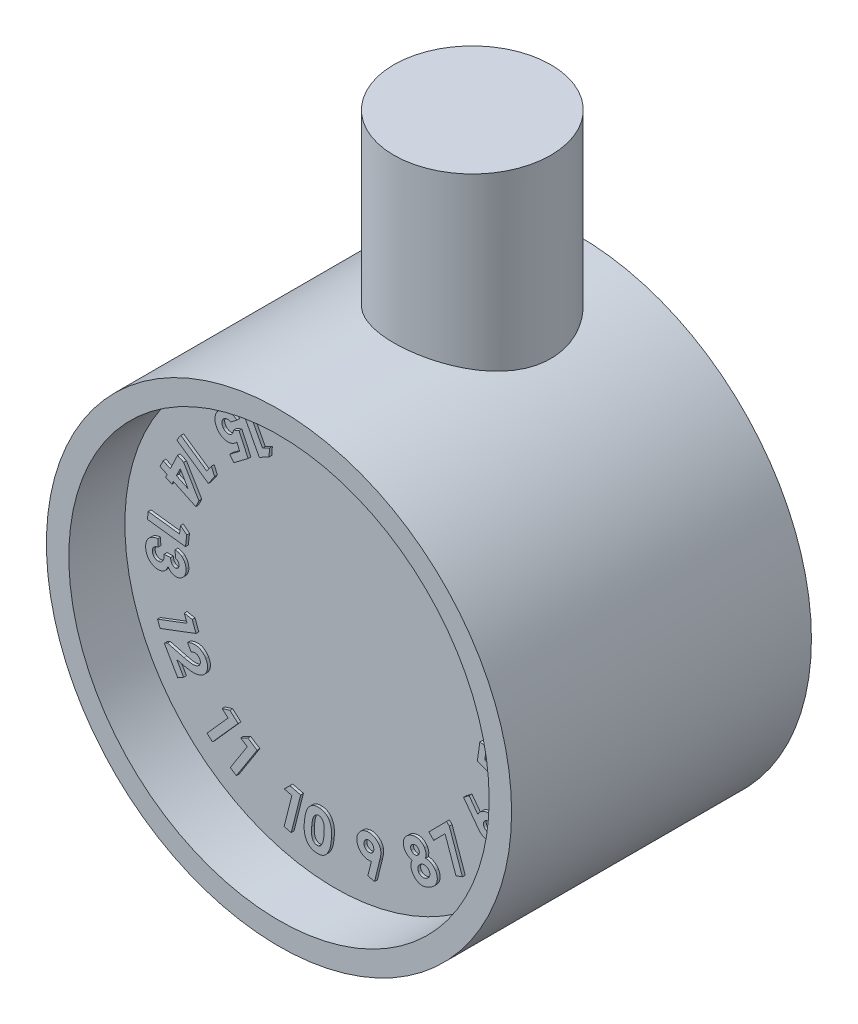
from build123d import *

# Parameters (mm, degrees)
SKETCH1_R           = 21.082
BOSS_EXTRUDE1_DEPTH = 27.178
SKETCH2_R           = 7.112
BOSS_EXTRUDE2_DEPTH = 35.814
SKETCH3_R           = 19.05
CUT_EXTRUDE1_DEPTH  = 5.08
BOSS_EXTRUDE3_DEPTH = 0.254


with BuildPart() as part:
    # Sketch1 → Boss-Extrude1 (new body)
    with BuildSketch(Plane.XY):
        Circle(SKETCH1_R)
    extrude(amount=BOSS_EXTRUDE1_DEPTH)

    # Sketch2 → Boss-Extrude2 (add)
    with BuildSketch(Plane(origin=(0, 0, 0), x_dir=(1, 0, 0), z_dir=(0, 1, 0))):
        with Locations(Location((0, -9.652, 0), (0, 0, 90))):
            Circle(SKETCH2_R)
    extrude(amount=BOSS_EXTRUDE2_DEPTH)

    # Sketch3 → Cut-Extrude1 (cut)
    with BuildSketch(Plane.XY.offset(27.178)):
        Circle(SKETCH3_R)
    extrude(amount=-CUT_EXTRUDE1_DEPTH, mode=Mode.SUBTRACT)

    # Sketch4 → Boss-Extrude3 (add)
    # profile 1 of 22: a face of its own
    with BuildSketch(Plane.XY.offset(22.098)):
        with BuildLine():
            add(Edge.make_bspline(
                [(6.469513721, 11.597228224), (6.442656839, 11.612771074), (6.389759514, 11.643384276), (6.315087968, 11.694758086), (6.246600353, 11.75028722), (6.183009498, 11.808503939), (6.12541368, 11.870441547), (6.073179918, 11.935558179), (6.027687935, 12.004953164), (5.986711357, 12.077002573), (5.952073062, 12.152907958), (5.925133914, 12.232738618), (5.902787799, 12.315723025), (5.888655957, 12.402418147), (5.880063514, 12.492364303), (5.87813961, 12.585618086), (5.882526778, 12.682548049), (5.892947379, 12.783548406), (5.911491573, 12.889174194), (5.938179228, 13.000238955), (5.974718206, 13.116967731), (6.018601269, 13.239896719), (6.071620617, 13.36873836), (6.133532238, 13.503017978), (6.203645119, 13.643699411), (6.255566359, 13.738166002), (6.282314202, 13.786831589)],
                knots=[0, 0, 0, 0, 0.895225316, 1.763236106, 2.612173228, 3.437860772, 4.24907144, 5.050608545, 5.843702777, 6.640915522, 7.440748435, 8.246953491, 9.069771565, 9.91795827, 10.778284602, 11.675489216, 12.607065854, 13.576775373, 14.603487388, 15.699453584, 16.870633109, 18.13136264, 19.4651774, 20.88958991, 22.397635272, 24, 24, 24, 24], degree=3))
            add(Edge.make_bspline(
                [(6.282314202, 13.786831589), (6.309749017, 13.835663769), (6.363044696, 13.930526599), (6.446902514, 14.065091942), (6.529415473, 14.189441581), (6.611482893, 14.303126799), (6.692423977, 14.406661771), (6.77398854, 14.498598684), (6.854526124, 14.580294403), (6.934854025, 14.651778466), (7.015389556, 14.713385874), (7.094679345, 14.768592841), (7.174081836, 14.816350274), (7.253253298, 14.857436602), (7.332685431, 14.89025157), (7.41158014, 14.916584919), (7.490165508, 14.935510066), (7.568725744, 14.947705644), (7.647795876, 14.952497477), (7.727634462, 14.95072601), (7.808399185, 14.940102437), (7.890100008, 14.924450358), (7.972737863, 14.90080216), (8.056126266, 14.870598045), (8.140539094, 14.833477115), (8.195634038, 14.803842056), (8.223720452, 14.788734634)],
                knots=[0, 0, 0, 0, 1.624610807, 3.156016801, 4.598206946, 5.952974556, 7.222483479, 8.408744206, 9.516132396, 10.548691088, 11.525035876, 12.455905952, 13.35000593, 14.211111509, 15.040820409, 15.840487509, 16.621545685, 17.382846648, 18.14363427, 18.916766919, 19.6954382, 20.503822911, 21.327973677, 22.185790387, 23.075148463, 24, 24, 24, 24], degree=3))
            add(Edge.make_bspline(
                [(8.223720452, 14.788734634), (8.251529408, 14.772751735), (8.305874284, 14.741517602), (8.382136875, 14.689071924), (8.452184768, 14.633563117), (8.517143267, 14.575770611), (8.57467513, 14.513690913), (8.626025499, 14.448848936), (8.672067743, 14.381445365), (8.711285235, 14.310469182), (8.744367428, 14.236278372), (8.771896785, 14.159008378), (8.792954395, 14.078063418), (8.80732276, 13.993825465), (8.816767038, 13.906249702), (8.819096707, 13.815338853), (8.816466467, 13.720969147), (8.80707591, 13.622855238), (8.791197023, 13.519853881), (8.765245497, 13.411307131), (8.730806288, 13.296390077), (8.68704666, 13.175349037), (8.634781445, 13.047919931), (8.573904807, 12.914293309), (8.503296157, 12.774567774), (8.452062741, 12.680097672), (8.425643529, 12.631382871)],
                knots=[0, 0, 0, 0, 0.936632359, 1.830387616, 2.700388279, 3.546270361, 4.367410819, 5.169167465, 5.960627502, 6.749019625, 7.534361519, 8.331103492, 9.142451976, 9.974110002, 10.825264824, 11.7131607, 12.628350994, 13.58140853, 14.59040402, 15.670065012, 16.83855441, 18.093133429, 19.428053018, 20.860854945, 22.381256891, 24, 24, 24, 24], degree=3))
            add(Edge.make_bspline(
                [(8.425643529, 12.631382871), (8.387398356, 12.564683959), (8.313645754, 12.436060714), (8.198032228, 12.255189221), (8.081471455, 12.093629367), (7.96576222, 11.950012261), (7.848894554, 11.82589445), (7.732822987, 11.720022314), (7.616174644, 11.632701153), (7.534587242, 11.587951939), (7.495254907, 11.566378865)],
                knots=[0, 0, 0, 0, 1.287213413, 2.482282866, 3.592203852, 4.621352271, 5.568046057, 6.443515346, 7.249636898, 8, 8, 8, 8], degree=3))
            add(Edge.make_bspline(
                [(7.495254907, 11.566378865), (7.452636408, 11.547181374), (7.369268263, 11.509628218), (7.239860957, 11.470650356), (7.110459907, 11.449315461), (6.981089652, 11.445246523), (6.85172319, 11.457166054), (6.722573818, 11.486221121), (6.593949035, 11.532974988), (6.511615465, 11.575488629), (6.469513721, 11.597228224)],
                knots=[0, 0, 0, 0, 1.047023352, 2.048133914, 3.019677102, 3.978937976, 4.941811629, 5.924325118, 6.938591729, 8, 8, 8, 8], degree=3))
        make_face()
        with BuildLine():
            add(Edge.make_bspline(
                [(6.759778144, 12.153918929), (6.784197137, 12.141834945), (6.832488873, 12.117937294), (6.910751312, 12.097438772), (6.991247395, 12.092131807), (7.074391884, 12.100272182), (7.160352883, 12.127229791), (7.247901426, 12.175042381), (7.337210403, 12.243206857), (7.41173735, 12.314388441), (7.473446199, 12.382314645), (7.522346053, 12.443055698), (7.573750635, 12.511199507), (7.626333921, 12.587302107), (7.681592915, 12.670550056), (7.737999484, 12.761737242), (7.797079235, 12.860377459), (7.835714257, 12.929488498), (7.85563151, 12.965116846)],
                knots=[0, 0, 0, 0, 0.860010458, 1.700782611, 2.538039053, 3.399952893, 4.328056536, 5.366253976, 6.538443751, 7.87160645, 8.619836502, 9.43938815, 10.336638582, 11.318732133, 12.364165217, 13.496220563, 14.709243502, 16, 16, 16, 16], degree=3))
            add(Edge.make_bspline(
                [(7.85563151, 12.965116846), (7.881050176, 13.011410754), (7.929764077, 13.100131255), (7.993256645, 13.231037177), (8.048184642, 13.352418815), (8.091424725, 13.465584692), (8.12530913, 13.570016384), (8.147951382, 13.665910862), (8.16068139, 13.75323227), (8.162206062, 13.832593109), (8.154889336, 13.904648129), (8.141920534, 13.971038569), (8.122036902, 14.031602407), (8.097019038, 14.087590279), (8.06361443, 14.137153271), (8.024792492, 14.181958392), (7.979544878, 14.221167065), (7.945242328, 14.24187513), (7.927847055, 14.252376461)],
                knots=[0, 0, 0, 0, 1.76975092, 3.391659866, 4.874885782, 6.233546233, 7.449843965, 8.551814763, 9.532160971, 10.401737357, 11.204508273, 11.955676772, 12.664096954, 13.336984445, 14.003919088, 14.658973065, 15.319947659, 16, 16, 16, 16], degree=3))
            add(Edge.make_bspline(
                [(7.927847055, 14.252376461), (7.910318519, 14.261339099), (7.875978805, 14.278897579), (7.821182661, 14.295525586), (7.766044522, 14.304834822), (7.709806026, 14.306432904), (7.652576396, 14.29885769), (7.594257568, 14.284322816), (7.535419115, 14.260547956), (7.497395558, 14.239913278), (7.477726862, 14.229239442)],
                knots=[0, 0, 0, 0, 0.99651666, 1.952250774, 2.889289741, 3.8257291, 4.792855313, 5.807386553, 6.865812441, 8, 8, 8, 8], degree=3))
            add(Edge.make_bspline(
                [(7.477726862, 14.229239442), (7.453038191, 14.213648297), (7.401097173, 14.180847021), (7.327367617, 14.118059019), (7.2520511, 14.043181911), (7.175525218, 13.955004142), (7.098289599, 13.853122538), (7.019111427, 13.738808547), (6.938844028, 13.611328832), (6.887471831, 13.520627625), (6.860739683, 13.473430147)],
                knots=[0, 0, 0, 0, 0.710160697, 1.4940646, 2.351071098, 3.29475912, 4.333809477, 5.462359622, 6.679507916, 8, 8, 8, 8], degree=3))
            add(Edge.make_bspline(
                [(6.860739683, 13.473430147), (6.834426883, 13.425480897), (6.783774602, 13.333178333), (6.7168633, 13.197320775), (6.659439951, 13.071368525), (6.613656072, 12.954237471), (6.577270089, 12.846633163), (6.552186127, 12.747735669), (6.538578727, 12.658009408), (6.534322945, 12.577077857), (6.540597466, 12.503599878), (6.551981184, 12.436294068), (6.570355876, 12.374626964), (6.594725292, 12.318396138), (6.626804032, 12.268557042), (6.663988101, 12.223428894), (6.709028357, 12.185222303), (6.742662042, 12.164476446), (6.759778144, 12.153918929)],
                knots=[0, 0, 0, 0, 1.79183379, 3.449289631, 4.960736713, 6.325827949, 7.568041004, 8.680491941, 9.663796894, 10.537572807, 11.328654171, 12.075195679, 12.77049728, 13.432137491, 14.075809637, 14.706227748, 15.34160238, 16, 16, 16, 16], degree=3))
        make_face(mode=Mode.SUBTRACT)
    # profile 2 of 22: a face of its own
    with BuildSketch(Plane.XY.offset(22.098)):
        Polygon((9.509308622, 9.39702076), (8.784348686, 10.070798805), (11.150634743, 12.617273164), (11.631604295, 12.17065858), (9.688795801, 10.079913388), (10.213234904, 9.591932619), align=None)
    # profile 3 of 22: a face of its own
    with BuildSketch(Plane.XY.offset(22.098)):
        with BuildLine():
            Line((12.399559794, 7.497238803), (12.752925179, 6.958777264))
            add(Edge.make_bspline(
                [(12.752925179, 6.958777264), (12.713269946, 6.93645884), (12.635595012, 6.892742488), (12.516231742, 6.838373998), (12.397277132, 6.797187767), (12.279987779, 6.7662362), (12.163388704, 6.748626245), (12.048074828, 6.743172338), (11.933582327, 6.748337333), (11.821060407, 6.766814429), (11.711762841, 6.796401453), (11.606784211, 6.835511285), (11.506941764, 6.885601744), (11.413269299, 6.947316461), (11.323172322, 7.017383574), (11.239832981, 7.099452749), (11.161612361, 7.191589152), (11.115014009, 7.258906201), (11.091266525, 7.29321236)],
                knots=[0, 0, 0, 0, 1.151189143, 2.254898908, 3.313528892, 4.333388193, 5.320342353, 6.291398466, 7.250640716, 8.215137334, 9.17058001, 10.111953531, 11.045585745, 11.990445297, 12.946418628, 13.929235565, 14.944695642, 16, 16, 16, 16], degree=3))
            add(Edge.make_bspline(
                [(11.091266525, 7.29321236), (11.064451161, 7.336782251), (11.012098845, 7.421844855), (10.953640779, 7.557257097), (10.913830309, 7.69387731), (10.893320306, 7.831614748), (10.891466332, 7.969027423), (10.910511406, 8.105034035), (10.94691165, 8.239142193), (11.002621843, 8.368529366), (11.072053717, 8.489738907), (11.154363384, 8.597977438), (11.246119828, 8.693333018), (11.316881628, 8.743911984), (11.352083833, 8.769073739)],
                knots=[0, 0, 0, 0, 1.102878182, 2.153177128, 3.17153219, 4.165799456, 5.149302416, 6.126461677, 7.119935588, 8.139102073, 9.158131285, 10.126465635, 11.067964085, 12, 12, 12, 12], degree=3))
            add(Edge.make_bspline(
                [(11.352083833, 8.769073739), (11.37407834, 8.782990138), (11.418520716, 8.81110979), (11.489922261, 8.847114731), (11.565038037, 8.880555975), (11.644972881, 8.908709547), (11.728879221, 8.934307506), (11.816964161, 8.955649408), (11.909272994, 8.974237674), (12.006649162, 8.988078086), (12.110253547, 8.998223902), (12.22167931, 9.002085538), (12.341228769, 9.000598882), (12.46935063, 8.993107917), (12.605710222, 8.981387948), (12.750419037, 8.963578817), (12.903264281, 8.940322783), (13.007705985, 8.921686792), (13.061418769, 8.912102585)],
                knots=[0, 0, 0, 0, 0.710579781, 1.43580638, 2.18189132, 2.955307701, 3.749009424, 4.577384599, 5.430004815, 6.320204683, 7.262903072, 8.27230638, 9.364049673, 10.52769513, 11.777302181, 13.102060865, 14.509633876, 16, 16, 16, 16], degree=3))
            Line((13.061418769, 8.912102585), (13.618810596, 8.81254329))
            Line((13.618810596, 8.81254329), (12.940124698, 9.845996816))
            Line((12.940124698, 9.845996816), (13.450541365, 10.181133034))
            Line((13.450541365, 10.181133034), (14.770753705, 8.171717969))
            Line((14.770753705, 8.171717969), (14.506430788, 7.997839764))
            Line((14.506430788, 7.997839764), (13.001823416, 8.293713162))
            add(Edge.make_bspline(
                [(13.001823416, 8.293713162), (12.957918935, 8.302299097), (12.873289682, 8.318849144), (12.750118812, 8.340047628), (12.635563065, 8.356835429), (12.529444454, 8.369769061), (12.431907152, 8.377970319), (12.343080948, 8.383527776), (12.26253689, 8.383601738), (12.168785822, 8.377992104), (12.06280907, 8.36446999), (11.947289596, 8.337497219), (11.844620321, 8.300478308), (11.784718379, 8.265602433), (11.755929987, 8.248841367)],
                knots=[0, 0, 0, 0, 1.262151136, 2.43289308, 3.52578891, 4.528496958, 5.448439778, 6.287119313, 7.038808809, 7.719118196, 8.936110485, 10.047644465, 11.061713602, 12, 12, 12, 12], degree=3))
            add(Edge.make_bspline(
                [(11.755929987, 8.248841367), (11.729813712, 8.229982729), (11.679170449, 8.193413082), (11.618901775, 8.122556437), (11.575574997, 8.042718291), (11.548819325, 7.95549878), (11.540182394, 7.864238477), (11.551464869, 7.772575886), (11.580267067, 7.681305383), (11.613764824, 7.62565017), (11.631130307, 7.596798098)],
                knots=[0, 0, 0, 0, 1.036992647, 2.010879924, 2.973152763, 3.951705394, 4.936752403, 5.909147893, 6.916086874, 8, 8, 8, 8], degree=3))
            add(Edge.make_bspline(
                [(11.631130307, 7.596798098), (11.641193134, 7.582611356), (11.660938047, 7.55477465), (11.69392872, 7.516382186), (11.730577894, 7.483369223), (11.770243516, 7.455164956), (11.81269506, 7.431042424), (11.858068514, 7.411497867), (11.906540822, 7.396766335), (11.957181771, 7.386078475), (12.010099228, 7.38150763), (12.063859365, 7.381279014), (12.118381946, 7.386991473), (12.1733614, 7.398688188), (12.229380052, 7.414431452), (12.285899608, 7.43682771), (12.34334322, 7.463747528), (12.380572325, 7.485926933), (12.399559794, 7.497238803)],
                knots=[0, 0, 0, 0, 0.964680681, 1.892861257, 2.801641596, 3.693901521, 4.588043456, 5.505659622, 6.42839095, 7.394638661, 8.371268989, 9.369603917, 10.373312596, 11.40567022, 12.484917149, 13.597299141, 14.774582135, 16, 16, 16, 16], degree=3))
        make_face()
    # profile 4 of 22: a face of its own
    with BuildSketch(Plane.XY.offset(22.098)):
        with BuildLine():
            Line((13.536679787, 4.333956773), (13.74911969, 3.733095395))
            add(Edge.make_bspline(
                [(13.74911969, 3.733095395), (13.717890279, 3.7266814), (13.656705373, 3.714115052), (13.565139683, 3.705299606), (13.476638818, 3.699965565), (13.390614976, 3.704180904), (13.30671154, 3.71324592), (13.22586076, 3.731516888), (13.146758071, 3.753889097), (13.09686854, 3.775524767), (13.071836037, 3.786380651)],
                knots=[0, 0, 0, 0, 1.105741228, 2.166376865, 3.189625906, 4.180100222, 5.152065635, 6.114643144, 7.054005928, 8, 8, 8, 8], degree=3))
            add(Edge.make_bspline(
                [(13.071836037, 3.786380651), (13.038298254, 3.803035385), (12.972053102, 3.835932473), (12.879484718, 3.896097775), (12.795258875, 3.964918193), (12.71913381, 4.041964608), (12.650355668, 4.126710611), (12.590348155, 4.220206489), (12.537782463, 4.321823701), (12.510247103, 4.393953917), (12.496215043, 4.43071158)],
                knots=[0, 0, 0, 0, 1.010660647, 1.996296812, 2.974182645, 3.942673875, 4.916579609, 5.916242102, 6.938113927, 8, 8, 8, 8], degree=3))
            add(Edge.make_bspline(
                [(12.496215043, 4.43071158), (12.485332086, 4.463962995), (12.463876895, 4.529516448), (12.442495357, 4.629349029), (12.429402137, 4.727817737), (12.426509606, 4.825094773), (12.433747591, 4.920876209), (12.449775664, 5.015600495), (12.476081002, 5.10893079), (12.510795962, 5.200337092), (12.553910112, 5.287012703), (12.603320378, 5.367376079), (12.657608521, 5.441164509), (12.720164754, 5.505679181), (12.787725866, 5.563498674), (12.860826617, 5.614530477), (12.940845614, 5.656894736), (12.997506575, 5.678805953), (13.02626312, 5.689926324)],
                knots=[0, 0, 0, 0, 1.104219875, 2.176912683, 3.218666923, 4.237583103, 5.24402053, 6.247449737, 7.266312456, 8.301168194, 9.330958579, 10.318271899, 11.277717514, 12.217314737, 13.149111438, 14.082660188, 15.02691256, 16, 16, 16, 16], degree=3))
            add(Edge.make_bspline(
                [(13.02626312, 5.689926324), (13.062435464, 5.701455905), (13.134122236, 5.724305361), (13.246108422, 5.736484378), (13.358261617, 5.734169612), (13.470112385, 5.713892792), (13.580653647, 5.678390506), (13.687366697, 5.624793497), (13.790259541, 5.55477579), (13.85242655, 5.497276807), (13.884436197, 5.467670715)],
                knots=[0, 0, 0, 0, 0.97033878, 1.923028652, 2.86920707, 3.835715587, 4.82395023, 5.833283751, 6.884362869, 8, 8, 8, 8], degree=3))
            add(Edge.make_bspline(
                [(13.884436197, 5.467670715), (13.883560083, 5.494783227), (13.88182944, 5.548340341), (13.886347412, 5.627536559), (13.895644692, 5.704330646), (13.912515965, 5.777856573), (13.932294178, 5.849484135), (13.959221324, 5.918094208), (13.991497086, 5.984269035), (14.029395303, 6.047283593), (14.072133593, 6.106788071), (14.119263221, 6.16258245), (14.171097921, 6.213779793), (14.227555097, 6.259927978), (14.287488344, 6.3025838), (14.352339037, 6.340339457), (14.421394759, 6.374124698), (14.469944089, 6.392369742), (14.494412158, 6.401564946)],
                knots=[0, 0, 0, 0, 1.082527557, 2.138387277, 3.163793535, 4.166751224, 5.147234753, 6.127984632, 7.104464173, 8.083792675, 9.060004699, 10.02653682, 10.996440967, 11.964143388, 12.934944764, 13.930321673, 14.956915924, 16, 16, 16, 16], degree=3))
            add(Edge.make_bspline(
                [(14.494412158, 6.401564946), (14.530902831, 6.413283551), (14.603026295, 6.436445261), (14.713296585, 6.457993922), (14.823012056, 6.467893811), (14.932084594, 6.466706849), (15.040697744, 6.453200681), (15.148574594, 6.42776851), (15.255478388, 6.390104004), (15.360880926, 6.341863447), (15.462563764, 6.283897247), (15.556913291, 6.215032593), (15.644468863, 6.138524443), (15.724244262, 6.052372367), (15.795607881, 5.956645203), (15.85944689, 5.852374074), (15.916397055, 5.739539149), (15.946478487, 5.659393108), (15.961860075, 5.618411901)],
                knots=[0, 0, 0, 0, 0.98987881, 1.956485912, 2.89651486, 3.832810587, 4.770041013, 5.719415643, 6.691724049, 7.694492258, 8.711888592, 9.71106672, 10.708271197, 11.712693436, 12.739512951, 13.788912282, 14.869400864, 16, 16, 16, 16], degree=3))
            add(Edge.make_bspline(
                [(15.961860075, 5.618411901), (15.974639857, 5.579098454), (15.99964134, 5.502188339), (16.025901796, 5.385636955), (16.040415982, 5.271322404), (16.045427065, 5.159310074), (16.037063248, 5.049654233), (16.019306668, 4.942163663), (15.98922466, 4.837103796), (15.949566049, 4.734747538), (15.899042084, 4.636907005), (15.839252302, 4.544344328), (15.769363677, 4.458385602), (15.689709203, 4.379033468), (15.600612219, 4.30575605), (15.502440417, 4.238468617), (15.394344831, 4.177782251), (15.317585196, 4.143357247), (15.278266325, 4.1257236)],
                knots=[0, 0, 0, 0, 1.081888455, 2.116531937, 3.122109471, 4.095662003, 5.046432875, 5.996002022, 6.94320267, 7.902187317, 8.865437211, 9.820921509, 10.782245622, 11.760038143, 12.759678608, 13.798330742, 14.872230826, 16, 16, 16, 16], degree=3))
            Line((15.278266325, 4.1257236), (15.059516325, 4.744814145))
            add(Edge.make_bspline(
                [(15.059516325, 4.744814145), (15.078842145, 4.755766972), (15.116332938, 4.777014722), (15.168406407, 4.812409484), (15.215571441, 4.848835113), (15.258025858, 4.886772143), (15.295254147, 4.926570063), (15.326899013, 4.968315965), (15.35416803, 5.011154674), (15.381503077, 5.070927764), (15.40644064, 5.148541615), (15.415932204, 5.246526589), (15.406944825, 5.348017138), (15.386356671, 5.413971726), (15.375722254, 5.448039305)],
                knots=[0, 0, 0, 0, 0.93818308, 1.820012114, 2.657438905, 3.454483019, 4.223005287, 4.955677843, 5.6652997, 6.363215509, 7.72800397, 9.087782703, 10.495749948, 12, 12, 12, 12], degree=3))
            add(Edge.make_bspline(
                [(15.375722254, 5.448039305), (15.369090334, 5.465737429), (15.35599585, 5.500681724), (15.330076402, 5.549406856), (15.302805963, 5.595594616), (15.269725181, 5.636094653), (15.234653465, 5.673964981), (15.195311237, 5.707500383), (15.152328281, 5.737141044), (15.091264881, 5.770186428), (15.011403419, 5.800730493), (14.91156224, 5.81758298), (14.80977559, 5.812888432), (14.74443353, 5.793685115), (14.711058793, 5.783876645)],
                knots=[0, 0, 0, 0, 0.818229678, 1.615564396, 2.388659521, 3.138510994, 3.876570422, 4.623680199, 5.37387368, 6.135401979, 7.629209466, 9.056345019, 10.496470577, 12, 12, 12, 12], degree=3))
            add(Edge.make_bspline(
                [(14.711058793, 5.783876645), (14.692827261, 5.77689871), (14.656968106, 5.763173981), (14.607650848, 5.734083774), (14.561568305, 5.701597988), (14.520867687, 5.662370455), (14.484010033, 5.618563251), (14.451499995, 5.569270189), (14.42466357, 5.513988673), (14.400537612, 5.454764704), (14.382090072, 5.390706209), (14.371259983, 5.322434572), (14.36643979, 5.250638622), (14.367807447, 5.175078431), (14.376675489, 5.095910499), (14.39134585, 5.012927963), (14.413305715, 4.926590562), (14.432145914, 4.868577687), (14.441828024, 4.838764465)],
                knots=[0, 0, 0, 0, 0.85291043, 1.677568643, 2.498029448, 3.315616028, 4.143313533, 5.00007929, 5.892083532, 6.828491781, 7.796543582, 8.802127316, 9.847901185, 10.942555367, 12.104889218, 13.330831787, 14.628295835, 16, 16, 16, 16], degree=3))
            Line((14.441828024, 4.838764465), (13.905469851, 4.648760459))
            add(Edge.make_bspline(
                [(13.905469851, 4.648760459), (13.889748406, 4.682844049), (13.860267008, 4.746758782), (13.813122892, 4.833157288), (13.766170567, 4.903547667), (13.71917957, 4.959253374), (13.670616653, 5.002534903), (13.620735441, 5.037488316), (13.567433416, 5.06366092), (13.512149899, 5.081715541), (13.45628788, 5.092477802), (13.400988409, 5.094667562), (13.346984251, 5.088540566), (13.312666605, 5.078142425), (13.295493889, 5.072939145)],
                knots=[0, 0, 0, 0, 1.636175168, 3.068212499, 4.286231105, 5.319563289, 6.235963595, 7.114950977, 7.967070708, 8.814486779, 9.643823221, 10.439164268, 11.218950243, 12, 12, 12, 12], degree=3))
            add(Edge.make_bspline(
                [(13.295493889, 5.072939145), (13.274294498, 5.064155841), (13.233101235, 5.047088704), (13.178823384, 5.008433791), (13.136450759, 4.958469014), (13.103145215, 4.901276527), (13.082742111, 4.836638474), (13.076011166, 4.767785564), (13.08216898, 4.695296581), (13.09704941, 4.648078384), (13.104788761, 4.623520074)],
                knots=[0, 0, 0, 0, 1.004149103, 1.951196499, 2.888211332, 3.856747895, 4.83547674, 5.834751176, 6.873848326, 8, 8, 8, 8], degree=3))
            add(Edge.make_bspline(
                [(13.104788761, 4.623520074), (13.11334479, 4.601849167), (13.130280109, 4.558955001), (13.169556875, 4.501864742), (13.216244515, 4.450547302), (13.271384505, 4.406773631), (13.332568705, 4.371730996), (13.39822903, 4.347698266), (13.466656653, 4.333618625), (13.513244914, 4.333843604), (13.536679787, 4.333956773)],
                knots=[0, 0, 0, 0, 1.001981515, 1.983265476, 2.967805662, 3.986331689, 5.006552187, 5.995211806, 6.991549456, 8, 8, 8, 8], degree=3))
        make_face()
    # profile 5 of 22: a face of its own
    with BuildSketch(Plane.XY.offset(22.098)):
        Polygon((13.188426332, 1.58440059), (13.121819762, 2.24065059), (15.341571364, 2.466411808), (15.310020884, 2.773503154), (15.917192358, 2.83450075), (15.948742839, 2.527409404), (16.656875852, 2.599624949), (16.722080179, 1.957397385), (16.013947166, 1.88518184), (16.166791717, 0.379873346), (15.559620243, 0.31887575), align=None)
        Polygon((15.406775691, 1.824184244), (14.251326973, 1.706395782), (15.486703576, 1.036824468), align=None, mode=Mode.SUBTRACT)
    # profile 6 of 22: a face of its own
    with BuildSketch(Plane.XY.offset(22.098)):
        with BuildLine():
            Line((13.152025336, -2.369506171), (13.379188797, -0.754822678))
            Line((13.379188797, -0.754822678), (13.984256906, -0.839658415))
            Line((13.984256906, -0.839658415), (13.825803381, -1.964958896))
            Line((13.825803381, -1.964958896), (14.434377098, -2.193524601))
            add(Edge.make_bspline(
                [(14.434377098, -2.193524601), (14.432067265, -2.173681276), (14.427511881, -2.134546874), (14.42433365, -2.076218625), (14.426720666, -2.020229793), (14.430468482, -1.983873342), (14.432273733, -1.966361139)],
                knots=[0, 0, 0, 0, 1.052154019, 2.075026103, 3.072777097, 4, 4, 4, 4], degree=3))
            add(Edge.make_bspline(
                [(14.432273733, -1.966361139), (14.438454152, -1.928083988), (14.450571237, -1.853039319), (14.482647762, -1.745213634), (14.521098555, -1.642991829), (14.570935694, -1.547497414), (14.629826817, -1.458575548), (14.697657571, -1.375567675), (14.775340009, -1.299829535), (14.861157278, -1.230628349), (14.954073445, -1.17007814), (15.051460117, -1.118493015), (15.153523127, -1.078103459), (15.2598603, -1.049002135), (15.3703349, -1.028783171), (15.485209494, -1.021253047), (15.604226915, -1.021777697), (15.684302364, -1.031642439), (15.725142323, -1.036673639)],
                knots=[0, 0, 0, 0, 1.042583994, 2.044048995, 3.02184235, 3.97844262, 4.936283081, 5.888322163, 6.858048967, 7.851281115, 8.851025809, 9.838664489, 10.812889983, 11.798824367, 12.802026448, 13.830163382, 14.893343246, 16, 16, 16, 16], degree=3))
            add(Edge.make_bspline(
                [(15.725142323, -1.036673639), (15.766217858, -1.04332001), (15.847127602, -1.056411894), (15.963880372, -1.090140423), (16.074396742, -1.13262968), (16.178472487, -1.185769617), (16.276021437, -1.248894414), (16.366971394, -1.322200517), (16.45094419, -1.405906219), (16.527902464, -1.498166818), (16.596072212, -1.597034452), (16.654353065, -1.699728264), (16.69989797, -1.806164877), (16.734581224, -1.915557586), (16.75802258, -2.028307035), (16.768768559, -2.144404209), (16.769271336, -2.263492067), (16.760325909, -2.343149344), (16.755791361, -2.383528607)],
                knots=[0, 0, 0, 0, 1.056256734, 2.080592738, 3.080636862, 4.060454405, 5.043630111, 6.027450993, 7.022459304, 8.051002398, 9.075390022, 10.069600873, 11.045669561, 12.010842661, 12.980806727, 13.965057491, 14.968462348, 16, 16, 16, 16], degree=3))
            add(Edge.make_bspline(
                [(16.755791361, -2.383528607), (16.750053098, -2.419396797), (16.73870702, -2.490317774), (16.711992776, -2.59333845), (16.677228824, -2.691054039), (16.63659711, -2.78440361), (16.588371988, -2.87286339), (16.531788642, -2.955837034), (16.468470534, -3.033930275), (16.398521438, -3.106848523), (16.322345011, -3.173029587), (16.241284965, -3.232684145), (16.154860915, -3.283611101), (16.063936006, -3.327433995), (15.968176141, -3.363311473), (15.867428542, -3.390967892), (15.762114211, -3.412806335), (15.689715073, -3.419759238), (15.652926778, -3.423292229)],
                knots=[0, 0, 0, 0, 1.057774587, 2.091502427, 3.094944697, 4.076577, 5.054637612, 6.025252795, 6.99818144, 7.980474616, 8.964889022, 9.934476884, 10.908286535, 11.88273858, 12.871639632, 13.882606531, 14.924085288, 16, 16, 16, 16], degree=3))
            Line((15.652926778, -3.423292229), (15.749681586, -2.734089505))
            add(Edge.make_bspline(
                [(15.749681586, -2.734089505), (15.777310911, -2.724008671), (15.830899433, -2.704456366), (15.904895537, -2.664626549), (15.969937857, -2.617051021), (16.024991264, -2.560974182), (16.070595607, -2.498902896), (16.10766293, -2.4323278), (16.13333823, -2.359922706), (16.142532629, -2.309607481), (16.147217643, -2.283969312)],
                knots=[0, 0, 0, 0, 1.110600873, 2.154068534, 3.164710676, 4.145451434, 5.111924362, 6.068658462, 7.015883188, 8, 8, 8, 8], degree=3))
            add(Edge.make_bspline(
                [(16.147217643, -2.283969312), (16.149202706, -2.265996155), (16.15311333, -2.23058857), (16.152885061, -2.177748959), (16.148246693, -2.126253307), (16.137647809, -2.076131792), (16.121282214, -2.027607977), (16.100124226, -1.980431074), (16.074078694, -1.934475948), (16.042605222, -1.890724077), (16.007108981, -1.849731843), (15.968324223, -1.811908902), (15.925599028, -1.779215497), (15.879380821, -1.750657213), (15.829616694, -1.727138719), (15.776438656, -1.707258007), (15.719912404, -1.691703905), (15.680580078, -1.685534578), (15.660639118, -1.682406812)],
                knots=[0, 0, 0, 0, 1.003067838, 1.976069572, 2.9274687, 3.868908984, 4.812492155, 5.764863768, 6.735180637, 7.739589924, 8.751345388, 9.742258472, 10.741291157, 11.731439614, 12.752715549, 13.791313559, 14.880225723, 16, 16, 16, 16], degree=3))
            add(Edge.make_bspline(
                [(15.660639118, -1.682406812), (15.64103843, -1.679878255), (15.602643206, -1.674925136), (15.545593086, -1.674838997), (15.490695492, -1.677935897), (15.437821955, -1.686345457), (15.387247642, -1.699915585), (15.338128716, -1.71729667), (15.291591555, -1.740565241), (15.247152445, -1.767926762), (15.20647926, -1.799134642), (15.169444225, -1.832798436), (15.137943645, -1.869637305), (15.110236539, -1.90844213), (15.086830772, -1.949911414), (15.068808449, -1.994558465), (15.054391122, -2.041423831), (15.049117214, -2.074016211), (15.046456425, -2.090459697)],
                knots=[0, 0, 0, 0, 1.151090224, 2.254837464, 3.319805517, 4.354713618, 5.369330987, 6.36929574, 7.38692778, 8.396500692, 9.407543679, 10.371780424, 11.308773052, 12.227457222, 13.148563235, 14.077196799, 15.029908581, 16, 16, 16, 16], degree=3))
            add(Edge.make_bspline(
                [(15.046456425, -2.090459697), (15.04454539, -2.108437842), (15.040701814, -2.144596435), (15.044233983, -2.199710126), (15.053174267, -2.255493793), (15.06950619, -2.311717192), (15.093031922, -2.368235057), (15.123376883, -2.424844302), (15.160207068, -2.482276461), (15.188724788, -2.519289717), (15.203507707, -2.538476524)],
                knots=[0, 0, 0, 0, 0.886798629, 1.783576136, 2.702858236, 3.658631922, 4.652277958, 5.705252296, 6.81045643, 8, 8, 8, 8], degree=3))
            Line((15.203507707, -2.538476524), (15.008595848, -3.05660553))
            Line((15.008595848, -3.05660553), (13.152025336, -2.369506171))
        make_face()
    # profile 7 of 22: a face of its own
    with BuildSketch(Plane.XY.offset(22.098)):
        with BuildLine():
            Line((11.903493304, -5.837450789), (12.406898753, -5.457442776))
            Line((12.406898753, -5.457442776), (13.199166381, -6.528756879))
            add(Edge.make_bspline(
                [(13.199166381, -6.528756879), (13.216039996, -6.496585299), (13.249246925, -6.433272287), (13.309769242, -6.346053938), (13.376221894, -6.266009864), (13.451227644, -6.19533439), (13.53205443, -6.131618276), (13.620399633, -6.076486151), (13.716168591, -6.03068282), (13.817278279, -5.991924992), (13.922331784, -5.963590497), (14.028422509, -5.945215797), (14.134577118, -5.937186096), (14.24082135, -5.940757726), (14.347168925, -5.955788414), (14.453226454, -5.981212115), (14.559521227, -6.016964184), (14.628101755, -6.048975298), (14.663108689, -6.065315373)],
                knots=[0, 0, 0, 0, 1.017672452, 2.002758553, 2.970097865, 3.929481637, 4.886355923, 5.851807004, 6.842348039, 7.858521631, 8.883781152, 9.887776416, 10.87329828, 11.863275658, 12.86223339, 13.879399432, 14.917539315, 16, 16, 16, 16], degree=3))
            add(Edge.make_bspline(
                [(14.663108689, -6.065315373), (14.696240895, -6.082615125), (14.761295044, -6.116582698), (14.850500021, -6.178761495), (14.932782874, -6.245861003), (15.005890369, -6.321372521), (15.070619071, -6.404049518), (15.127922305, -6.493158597), (15.1753591, -6.590166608), (15.215077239, -6.692114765), (15.245103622, -6.797521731), (15.264836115, -6.903396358), (15.274098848, -7.008591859), (15.272887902, -7.113166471), (15.260106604, -7.217023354), (15.236444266, -7.320202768), (15.203414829, -7.423019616), (15.172399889, -7.48889616), (15.156698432, -7.522246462)],
                knots=[0, 0, 0, 0, 1.046956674, 2.055669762, 3.042305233, 4.020044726, 4.99532195, 5.982349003, 6.984549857, 8.017655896, 9.046430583, 10.052735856, 11.03277811, 12.002647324, 12.979574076, 13.960382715, 14.967434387, 16, 16, 16, 16], degree=3))
            add(Edge.make_bspline(
                [(15.156698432, -7.522246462), (15.138652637, -7.556513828), (15.103349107, -7.623552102), (15.040050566, -7.716300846), (14.96995886, -7.800070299), (14.892180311, -7.87477437), (14.808133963, -7.941003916), (14.716468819, -7.99751817), (14.618094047, -8.045323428), (14.513851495, -8.08318504), (14.407269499, -8.111740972), (14.301033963, -8.130756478), (14.196347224, -8.140611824), (14.093280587, -8.137726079), (13.991928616, -8.127217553), (13.892523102, -8.104746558), (13.794243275, -8.073695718), (13.731504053, -8.044584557), (13.699767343, -8.029858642)],
                knots=[0, 0, 0, 0, 1.084104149, 2.120865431, 3.138413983, 4.138439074, 5.136319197, 6.130003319, 7.148877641, 8.194754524, 9.231681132, 10.235854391, 11.214962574, 12.17092805, 13.11940023, 14.064477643, 15.020913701, 16, 16, 16, 16], degree=3))
            add(Edge.make_bspline(
                [(13.699767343, -8.029858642), (13.675946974, -8.017377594), (13.627995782, -7.992252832), (13.559566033, -7.947478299), (13.492415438, -7.898660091), (13.438763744, -7.851833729), (13.395242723, -7.809230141), (13.359356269, -7.770990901), (13.320328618, -7.727024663), (13.278156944, -7.676882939), (13.232536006, -7.62099869), (13.18451959, -7.558356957), (13.132496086, -7.49062876), (13.097421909, -7.443081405), (13.079274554, -7.418480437)],
                knots=[0, 0, 0, 0, 1.098937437, 2.212197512, 3.339800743, 4.49132191, 5.119744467, 5.829502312, 6.634956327, 7.523217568, 8.508187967, 9.584287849, 10.750112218, 12, 12, 12, 12], degree=3))
            Line((13.079274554, -7.418480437), (11.903493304, -5.837450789))
        make_face()
        with BuildLine():
            add(Edge.make_bspline(
                [(13.744639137, -6.8414572), (13.732895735, -6.868878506), (13.710028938, -6.922273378), (13.696752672, -7.008395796), (13.701823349, -7.094877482), (13.725496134, -7.179933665), (13.764239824, -7.261022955), (13.820186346, -7.332213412), (13.889372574, -7.394740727), (13.944646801, -7.424724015), (13.973204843, -7.440215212)],
                knots=[0, 0, 0, 0, 0.998770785, 1.944810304, 2.89630629, 3.888483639, 4.89263917, 5.894459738, 6.912149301, 8, 8, 8, 8], degree=3))
            add(Edge.make_bspline(
                [(13.973204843, -7.440215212), (14.002965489, -7.453021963), (14.060991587, -7.477992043), (14.153304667, -7.495998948), (14.245505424, -7.494145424), (14.335460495, -7.475388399), (14.41866038, -7.440563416), (14.492172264, -7.393385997), (14.552052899, -7.331745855), (14.58019503, -7.282685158), (14.594398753, -7.257923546)],
                knots=[0, 0, 0, 0, 1.080958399, 2.107608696, 3.115627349, 4.145364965, 5.16107565, 6.114569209, 7.048396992, 8, 8, 8, 8], degree=3))
            add(Edge.make_bspline(
                [(14.594398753, -7.257923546), (14.606397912, -7.230513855), (14.63002446, -7.17654371), (14.643627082, -7.088924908), (14.639339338, -7.000176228), (14.616237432, -6.912404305), (14.57869976, -6.828370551), (14.523307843, -6.754007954), (14.452386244, -6.690728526), (14.396224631, -6.65973764), (14.367235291, -6.643740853)],
                knots=[0, 0, 0, 0, 0.980891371, 1.931391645, 2.885863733, 3.885350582, 4.900243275, 5.895136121, 6.913517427, 8, 8, 8, 8], degree=3))
            add(Edge.make_bspline(
                [(14.367235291, -6.643740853), (14.337496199, -6.630653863), (14.279796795, -6.605262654), (14.188065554, -6.587302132), (14.09703812, -6.589132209), (14.008308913, -6.607759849), (13.925603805, -6.643728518), (13.851578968, -6.693954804), (13.789746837, -6.76085733), (13.759946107, -6.814106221), (13.744639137, -6.8414572)],
                knots=[0, 0, 0, 0, 1.066957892, 2.070097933, 3.04706459, 4.045741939, 5.034506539, 5.996737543, 6.971036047, 8, 8, 8, 8], degree=3))
        make_face(mode=Mode.SUBTRACT)
    # profile 8 of 22: a face of its own
    with BuildSketch(Plane.XY.offset(22.098)):
        Polygon((8.756248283, -10.130851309), (10.361817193, -8.502846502), (10.610014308, -8.747538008), (11.801220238, -12.132554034), (11.212979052, -12.340787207), (10.224397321, -9.529288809), (9.200058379, -10.568351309), align=None)
    # profile 9 of 22: a face of its own
    with BuildSketch(Plane.XY.offset(22.098)):
        with BuildLine():
            add(Edge.make_bspline(
                [(8.461303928, -12.340587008), (8.507229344, -12.342949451), (8.598194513, -12.347628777), (8.731338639, -12.374585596), (8.85814504, -12.41902926), (8.97874869, -12.477577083), (9.09053263, -12.551056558), (9.192279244, -12.637700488), (9.282649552, -12.737442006), (9.332765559, -12.812467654), (9.358038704, -12.850302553)],
                knots=[0, 0, 0, 0, 1.024342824, 2.028931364, 3.016068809, 4.013536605, 5.010800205, 5.990315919, 6.986530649, 8, 8, 8, 8], degree=3))
            add(Edge.make_bspline(
                [(9.358038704, -12.850302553), (9.382342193, -12.893193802), (9.430554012, -12.978278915), (9.481948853, -13.115436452), (9.512606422, -13.257896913), (9.523079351, -13.379208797), (9.522271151, -13.476510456), (9.51665068, -13.548437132), (9.506199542, -13.618507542), (9.490743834, -13.686955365), (9.470062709, -13.753532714), (9.446065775, -13.819113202), (9.415195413, -13.882105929), (9.381078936, -13.944382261), (9.34075193, -14.004694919), (9.295156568, -14.064029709), (9.242700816, -14.121017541), (9.186100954, -14.17869099), (9.121831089, -14.23320752), (9.053208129, -14.288488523), (8.978111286, -14.341594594), (8.925135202, -14.375015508), (8.898102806, -14.39206938)],
                knots=[0, 0, 0, 0, 1.628498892, 3.230519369, 4.820788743, 6.434382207, 7.245940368, 8.036696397, 8.818220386, 9.586951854, 10.354633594, 11.122626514, 11.89353064, 12.671991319, 13.469404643, 14.290293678, 15.14396476, 16.029305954, 16.960679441, 17.928721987, 18.943077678, 20, 20, 20, 20], degree=3))
            add(Edge.make_bspline(
                [(8.898102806, -14.39206938), (8.868816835, -14.409874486), (8.811651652, -14.444629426), (8.725442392, -14.490779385), (8.641793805, -14.53070077), (8.56145006, -14.565603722), (8.483034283, -14.592935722), (8.407421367, -14.614634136), (8.334294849, -14.631497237), (8.240390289, -14.643161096), (8.124921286, -14.644934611), (7.988285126, -14.62752312), (7.854023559, -14.588688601), (7.723754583, -14.530450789), (7.599283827, -14.454665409), (7.487081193, -14.359132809), (7.383845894, -14.2493904), (7.328023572, -14.164661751), (7.299545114, -14.121436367)],
                knots=[0, 0, 0, 0, 0.894335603, 1.745711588, 2.550479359, 3.312900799, 4.030481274, 4.715790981, 5.365432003, 5.986530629, 7.182109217, 8.36908478, 9.567956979, 10.815801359, 12.083638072, 13.356540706, 14.651406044, 16, 16, 16, 16], degree=3))
            add(Edge.make_bspline(
                [(7.299545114, -14.121436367), (7.276931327, -14.082485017), (7.232471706, -14.005905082), (7.185719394, -13.883082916), (7.151331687, -13.759057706), (7.135815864, -13.631595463), (7.13487077, -13.501657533), (7.150920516, -13.368993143), (7.182381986, -13.233733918), (7.214909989, -13.14517022), (7.2315363, -13.099901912)],
                knots=[0, 0, 0, 0, 1.013656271, 1.99288931, 2.952542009, 3.908486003, 4.877806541, 5.874942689, 6.913801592, 8, 8, 8, 8], degree=3))
            add(Edge.make_bspline(
                [(7.2315363, -13.099901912), (7.196277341, -13.090495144), (7.127404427, -13.07212048), (7.029312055, -13.034194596), (6.93760882, -12.990421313), (6.853265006, -12.938143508), (6.775379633, -12.87913255), (6.705275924, -12.812013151), (6.64116187, -12.738237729), (6.605302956, -12.683644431), (6.587205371, -12.656091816)],
                knots=[0, 0, 0, 0, 1.089498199, 2.128165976, 3.136807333, 4.121159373, 5.087518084, 6.050566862, 7.016143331, 8, 8, 8, 8], degree=3))
            add(Edge.make_bspline(
                [(6.587205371, -12.656091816), (6.565063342, -12.617373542), (6.521559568, -12.541301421), (6.47593202, -12.41873904), (6.44701469, -12.293352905), (6.434741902, -12.165277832), (6.441162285, -12.037341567), (6.46515984, -11.911747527), (6.507221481, -11.790109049), (6.566127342, -11.672574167), (6.643312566, -11.561852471), (6.735623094, -11.458091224), (6.844565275, -11.36319138), (6.926558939, -11.309455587), (6.968615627, -11.281893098)],
                knots=[0, 0, 0, 0, 1.003051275, 1.970755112, 2.932083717, 3.894103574, 4.858380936, 5.806947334, 6.763944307, 7.747771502, 8.757990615, 9.794263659, 10.8686203, 12, 12, 12, 12], degree=3))
            add(Edge.make_bspline(
                [(6.968615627, -11.281893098), (7.01151448, -11.256923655), (7.094970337, -11.208347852), (7.22709001, -11.155857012), (7.358979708, -11.119861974), (7.491361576, -11.102952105), (7.622072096, -11.104245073), (7.749926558, -11.123472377), (7.874282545, -11.15995472), (7.992899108, -11.215076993), (8.103930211, -11.284235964), (8.205359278, -11.365792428), (8.294017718, -11.461174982), (8.342333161, -11.533133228), (8.366652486, -11.569353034)],
                knots=[0, 0, 0, 0, 1.118326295, 2.175603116, 3.196068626, 4.195218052, 5.175837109, 6.135384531, 7.102878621, 8.088924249, 9.076350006, 10.0470704, 11.017003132, 12, 12, 12, 12], degree=3))
            add(Edge.make_bspline(
                [(8.366652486, -11.569353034), (8.381839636, -11.595979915), (8.411809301, -11.648524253), (8.448251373, -11.730834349), (8.472956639, -11.815646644), (8.490653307, -11.903069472), (8.498215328, -11.997376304), (8.495426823, -12.101562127), (8.483155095, -12.217500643), (8.468840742, -12.298132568), (8.461303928, -12.340587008)],
                knots=[0, 0, 0, 0, 0.921636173, 1.818717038, 2.699290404, 3.573218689, 4.497210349, 5.53766216, 6.703526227, 8, 8, 8, 8], degree=3))
        make_face()
        with BuildLine():
            add(Edge.make_bspline(
                [(7.286924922, -11.837882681), (7.26510575, -11.852383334), (7.222797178, -11.880500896), (7.173471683, -11.937335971), (7.134546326, -11.99977749), (7.112389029, -12.070112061), (7.102598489, -12.143393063), (7.109320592, -12.217687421), (7.131431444, -12.291368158), (7.156772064, -12.336796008), (7.169837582, -12.360218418)],
                knots=[0, 0, 0, 0, 1.043422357, 2.023253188, 2.983667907, 3.968170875, 4.948046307, 5.923988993, 6.929617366, 8, 8, 8, 8], degree=3))
            add(Edge.make_bspline(
                [(7.169837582, -12.360218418), (7.185101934, -12.382667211), (7.214828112, -12.426384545), (7.273383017, -12.479112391), (7.33945424, -12.51913248), (7.412484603, -12.544891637), (7.488497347, -12.556278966), (7.564361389, -12.552046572), (7.638606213, -12.532204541), (7.683724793, -12.507514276), (7.706896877, -12.494833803)],
                knots=[0, 0, 0, 0, 1.052461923, 2.049590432, 3.036226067, 4.039465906, 5.04072778, 6.005650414, 6.975738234, 8, 8, 8, 8], degree=3))
            add(Edge.make_bspline(
                [(7.706896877, -12.494833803), (7.729071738, -12.4795244), (7.772129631, -12.449797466), (7.824278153, -12.39246192), (7.86250575, -12.327293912), (7.885162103, -12.25516646), (7.894823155, -12.179235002), (7.88751258, -12.101799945), (7.863548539, -12.024725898), (7.837054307, -11.976981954), (7.823283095, -11.952165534)],
                knots=[0, 0, 0, 0, 1.036942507, 2.013476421, 2.963036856, 3.929696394, 4.910550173, 5.897518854, 6.907169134, 8, 8, 8, 8], degree=3))
            add(Edge.make_bspline(
                [(7.823283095, -11.952165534), (7.808199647, -11.930017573), (7.778934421, -11.88704563), (7.722556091, -11.834677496), (7.657646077, -11.797472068), (7.586745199, -11.774422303), (7.512050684, -11.765839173), (7.435912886, -11.77316652), (7.359312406, -11.796824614), (7.311711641, -11.823823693), (7.286924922, -11.837882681)],
                knots=[0, 0, 0, 0, 1.041280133, 2.020313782, 2.966383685, 3.933498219, 4.904459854, 5.873542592, 6.892708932, 8, 8, 8, 8], degree=3))
        make_face(mode=Mode.SUBTRACT)
        with BuildLine():
            add(Edge.make_bspline(
                [(8.043435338, -13.01296281), (8.027143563, -13.023710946), (7.995156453, -13.044813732), (7.950686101, -13.080063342), (7.910566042, -13.118060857), (7.874563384, -13.158656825), (7.843585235, -13.202547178), (7.817055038, -13.248885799), (7.794188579, -13.297471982), (7.777031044, -13.348366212), (7.764507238, -13.39977439), (7.756653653, -13.450675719), (7.753606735, -13.500234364), (7.756389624, -13.548731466), (7.765076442, -13.595916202), (7.778244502, -13.642022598), (7.796604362, -13.687086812), (7.812888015, -13.715195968), (7.82117973, -13.729509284)],
                knots=[0, 0, 0, 0, 1.123539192, 2.205945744, 3.262613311, 4.301999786, 5.325141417, 6.350051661, 7.373635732, 8.412063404, 9.436973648, 10.417173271, 11.374187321, 12.290894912, 13.206910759, 14.131193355, 15.048394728, 16, 16, 16, 16], degree=3))
            add(Edge.make_bspline(
                [(7.82117973, -13.729509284), (7.83071282, -13.743974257), (7.849475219, -13.772443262), (7.882110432, -13.81099325), (7.916986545, -13.846021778), (7.956197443, -13.874890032), (7.996872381, -13.902018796), (8.042079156, -13.92204447), (8.089258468, -13.94043453), (8.156532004, -13.956617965), (8.243997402, -13.966209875), (8.350996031, -13.953948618), (8.458552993, -13.920779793), (8.52548925, -13.882995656), (8.560162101, -13.863423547)],
                knots=[0, 0, 0, 0, 0.741912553, 1.460183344, 2.161488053, 2.854733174, 3.543913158, 4.25198222, 4.968364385, 5.711830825, 7.212000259, 8.713206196, 10.297447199, 12, 12, 12, 12], degree=3))
            add(Edge.make_bspline(
                [(8.560162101, -13.863423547), (8.577392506, -13.852213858), (8.611244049, -13.830190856), (8.657893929, -13.793871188), (8.700100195, -13.755840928), (8.736009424, -13.715093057), (8.76845256, -13.673435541), (8.794990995, -13.629404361), (8.816065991, -13.583122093), (8.838473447, -13.520579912), (8.853174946, -13.439719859), (8.849551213, -13.342218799), (8.824880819, -13.245544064), (8.792243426, -13.186930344), (8.775406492, -13.156692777)],
                knots=[0, 0, 0, 0, 0.890708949, 1.749922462, 2.560200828, 3.349367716, 4.101101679, 4.846459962, 5.571718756, 6.302265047, 7.723078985, 9.101805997, 10.504883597, 12, 12, 12, 12], degree=3))
            add(Edge.make_bspline(
                [(8.775406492, -13.156692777), (8.765894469, -13.141986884), (8.747096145, -13.112924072), (8.714055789, -13.073713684), (8.677715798, -13.03918904), (8.639328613, -13.007852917), (8.597034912, -12.981901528), (8.551590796, -12.961102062), (8.50378322, -12.943015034), (8.436066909, -12.926834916), (8.349151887, -12.917570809), (8.244113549, -12.927870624), (8.140287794, -12.958839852), (8.076269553, -12.994614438), (8.043435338, -13.01296281)],
                knots=[0, 0, 0, 0, 0.756793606, 1.495628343, 2.210363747, 2.92216388, 3.634537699, 4.348844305, 5.08101398, 5.84083787, 7.354222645, 8.836446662, 10.377450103, 12, 12, 12, 12], degree=3))
        make_face(mode=Mode.SUBTRACT)
    # profile 10 of 22: a face of its own
    with BuildSketch(Plane.XY.offset(22.098)):
        with BuildLine():
            Line((3.839623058, -16.479376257), (3.227543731, -16.337749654))
            Line((3.227543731, -16.337749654), (3.546554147, -15.047685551))
            add(Edge.make_bspline(
                [(3.546554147, -15.047685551), (3.51115527, -15.055271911), (3.441313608, -15.070239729), (3.335687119, -15.07842059), (3.231866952, -15.078569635), (3.129981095, -15.066007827), (3.029483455, -15.044564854), (2.931123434, -15.011214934), (2.834555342, -14.967235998), (2.740589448, -14.913938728), (2.652326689, -14.850858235), (2.570332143, -14.781754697), (2.497485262, -14.704382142), (2.433325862, -14.620257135), (2.376257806, -14.529762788), (2.329092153, -14.431637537), (2.288330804, -14.327322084), (2.269527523, -14.254016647), (2.259995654, -14.216856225)],
                knots=[0, 0, 0, 0, 1.016500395, 2.005545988, 2.971213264, 3.93024419, 4.885013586, 5.855116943, 6.842940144, 7.863867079, 8.886377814, 9.888168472, 10.873301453, 11.86659185, 12.858142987, 13.874643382, 14.922601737, 16, 16, 16, 16], degree=3))
            add(Edge.make_bspline(
                [(2.259995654, -14.216856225), (2.252287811, -14.180281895), (2.237118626, -14.108302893), (2.226647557, -13.999747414), (2.22734547, -13.893337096), (2.238651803, -13.788810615), (2.260280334, -13.686313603), (2.2930949, -13.585911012), (2.335858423, -13.487302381), (2.389698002, -13.392268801), (2.451574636, -13.302338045), (2.520510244, -13.219854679), (2.595848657, -13.145811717), (2.67733936, -13.080514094), (2.764928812, -13.023530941), (2.859549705, -12.977300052), (2.959455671, -12.936730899), (3.029806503, -12.918523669), (3.065584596, -12.909264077)],
                knots=[0, 0, 0, 0, 1.048672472, 2.06380807, 3.054501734, 4.031149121, 5.010371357, 5.989659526, 6.991564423, 8.022624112, 9.050841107, 10.052144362, 11.035686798, 12.011121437, 12.979269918, 13.962177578, 14.963631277, 16, 16, 16, 16], degree=3))
            add(Edge.make_bspline(
                [(3.065584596, -12.909264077), (3.103311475, -12.901183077), (3.177319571, -12.885330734), (3.288831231, -12.876179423), (3.397484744, -12.876643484), (3.50407234, -12.887537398), (3.608205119, -12.910920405), (3.709721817, -12.94580783), (3.809067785, -12.990648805), (3.904304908, -13.046675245), (3.993768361, -13.110733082), (4.07625052, -13.17998404), (4.149659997, -13.254918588), (4.214795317, -13.334706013), (4.269244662, -13.421243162), (4.316627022, -13.5116837), (4.355168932, -13.607685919), (4.372716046, -13.674667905), (4.381590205, -13.708542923)],
                knots=[0, 0, 0, 0, 1.081764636, 2.122076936, 3.132116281, 4.128002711, 5.122506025, 6.120118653, 7.135679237, 8.176177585, 9.215352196, 10.220546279, 11.194486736, 12.155265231, 13.104966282, 14.058328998, 15.018032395, 16, 16, 16, 16], degree=3))
            add(Edge.make_bspline(
                [(4.381590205, -13.708542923), (4.387135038, -13.734882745), (4.398259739, -13.78772881), (4.40768711, -13.868637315), (4.412201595, -13.950850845), (4.41016008, -14.021100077), (4.405563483, -14.081177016), (4.399222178, -14.132639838), (4.389581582, -14.190491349), (4.379051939, -14.254759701), (4.363327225, -14.32477508), (4.347928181, -14.401741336), (4.327863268, -14.4845166), (4.313824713, -14.541946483), (4.306570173, -14.571623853)],
                knots=[0, 0, 0, 0, 1.106170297, 2.219329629, 3.345025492, 4.488824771, 5.105655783, 5.821939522, 6.6196936, 7.516963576, 8.498792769, 9.569204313, 10.743866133, 12, 12, 12, 12], degree=3))
            Line((4.306570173, -14.571623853), (3.839623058, -16.479376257))
        make_face()
        with BuildLine():
            add(Edge.make_bspline(
                [(3.439282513, -14.429296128), (3.467844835, -14.420956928), (3.523678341, -14.404655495), (3.597941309, -14.359193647), (3.662279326, -14.300955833), (3.711446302, -14.22737102), (3.749283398, -14.146215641), (3.768799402, -14.058085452), (3.772103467, -13.965897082), (3.760665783, -13.904739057), (3.75478732, -13.873306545)],
                knots=[0, 0, 0, 0, 0.998979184, 1.952800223, 2.906133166, 3.902593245, 4.914441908, 5.908189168, 6.924902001, 8, 8, 8, 8], degree=3))
            add(Edge.make_bspline(
                [(3.75478732, -13.873306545), (3.746044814, -13.841709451), (3.729070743, -13.780361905), (3.682201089, -13.69839117), (3.623456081, -13.626994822), (3.550550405, -13.570925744), (3.471676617, -13.527723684), (3.388451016, -13.502345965), (3.303283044, -13.495284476), (3.247781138, -13.505154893), (3.219831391, -13.510125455)],
                knots=[0, 0, 0, 0, 1.092149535, 2.120470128, 3.129886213, 4.16468723, 5.174919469, 6.121635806, 7.054090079, 8, 8, 8, 8], degree=3))
            add(Edge.make_bspline(
                [(3.219831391, -13.510125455), (3.191084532, -13.518524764), (3.134706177, -13.534997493), (3.058536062, -13.58000434), (2.993755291, -13.640480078), (2.94035139, -13.713782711), (2.900144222, -13.796491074), (2.878010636, -13.886227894), (2.874297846, -13.980538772), (2.885799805, -14.043101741), (2.891706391, -14.075229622)],
                knots=[0, 0, 0, 0, 0.985709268, 1.933173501, 2.888677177, 3.893288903, 4.91132116, 5.904970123, 6.924141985, 8, 8, 8, 8], degree=3))
            add(Edge.make_bspline(
                [(2.891706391, -14.075229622), (2.900600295, -14.106285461), (2.917865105, -14.166570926), (2.962671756, -14.248286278), (3.021009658, -14.318386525), (3.092434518, -14.374641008), (3.172536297, -14.416469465), (3.258392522, -14.440852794), (3.348984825, -14.446184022), (3.408556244, -14.435042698), (3.439282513, -14.429296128)],
                knots=[0, 0, 0, 0, 1.062345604, 2.062220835, 3.046778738, 4.050358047, 5.039398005, 6.007814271, 6.972452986, 8, 8, 8, 8], degree=3))
        make_face(mode=Mode.SUBTRACT)
    # profile 11 of 22: a face of its own
    with BuildSketch(Plane.XY.offset(22.098)):
        with BuildLine():
            add(Edge.make_bspline(
                [(-1.1519168, -13.202103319), (-1.120789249, -13.20549578), (-1.059442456, -13.212181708), (-0.969554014, -13.22803432), (-0.883616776, -13.250678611), (-0.801552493, -13.278969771), (-0.722546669, -13.311416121), (-0.648400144, -13.351165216), (-0.577443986, -13.395345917), (-0.511231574, -13.446038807), (-0.448102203, -13.501509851), (-0.390110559, -13.563585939), (-0.335625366, -13.630935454), (-0.28686516, -13.705043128), (-0.241728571, -13.784261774), (-0.20196041, -13.869564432), (-0.166075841, -13.960383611), (-0.134435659, -14.057476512), (-0.107518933, -14.162059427), (-0.086778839, -14.275232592), (-0.071544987, -14.397429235), (-0.061882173, -14.528473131), (-0.058122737, -14.668586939), (-0.058486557, -14.817565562), (-0.065995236, -14.975613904), (-0.074251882, -15.083700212), (-0.078499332, -15.139302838)],
                knots=[0, 0, 0, 0, 0.896886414, 1.767601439, 2.612050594, 3.439907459, 4.253123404, 5.055769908, 5.84708304, 6.645164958, 7.441925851, 8.251827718, 9.07577676, 9.920677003, 10.790155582, 11.685666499, 12.614399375, 13.586223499, 14.609258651, 15.70574492, 16.879990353, 18.135502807, 19.468459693, 20.8945601, 22.402474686, 24, 24, 24, 24], degree=3))
            add(Edge.make_bspline(
                [(-0.078499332, -15.139302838), (-0.08400179, -15.195431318), (-0.094703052, -15.304590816), (-0.115901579, -15.462861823), (-0.139811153, -15.611334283), (-0.16954475, -15.74944173), (-0.202301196, -15.877916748), (-0.238356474, -15.996554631), (-0.278892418, -16.105095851), (-0.32424094, -16.20352695), (-0.371890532, -16.294108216), (-0.423477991, -16.376747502), (-0.476628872, -16.45361835), (-0.532633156, -16.523855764), (-0.591551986, -16.587329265), (-0.653625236, -16.643342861), (-0.71745775, -16.693946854), (-0.785194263, -16.736576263), (-0.855985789, -16.773465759), (-0.930309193, -16.804312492), (-1.008439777, -16.828939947), (-1.090140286, -16.846891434), (-1.175380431, -16.859826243), (-1.264457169, -16.865595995), (-1.357445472, -16.866762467), (-1.420463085, -16.862193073), (-1.45269805, -16.859855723)],
                knots=[0, 0, 0, 0, 1.62339578, 3.157204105, 4.596155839, 5.951308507, 7.222443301, 8.412037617, 9.519155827, 10.554791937, 11.529920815, 12.463430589, 13.357411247, 14.21898327, 15.047234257, 15.847355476, 16.623878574, 17.389098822, 18.147396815, 18.919535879, 19.702560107, 20.502341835, 21.325357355, 22.181924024, 23.070012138, 24, 24, 24, 24], degree=3))
            add(Edge.make_bspline(
                [(-1.45269805, -16.859855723), (-1.484782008, -16.856589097), (-1.547616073, -16.85019165), (-1.639284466, -16.832712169), (-1.726834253, -16.811504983), (-1.809905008, -16.784208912), (-1.888104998, -16.750690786), (-1.962646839, -16.713363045), (-2.032196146, -16.669393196), (-2.097797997, -16.620911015), (-2.159303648, -16.566949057), (-2.215022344, -16.505939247), (-2.268083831, -16.440792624), (-2.31639331, -16.369607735), (-2.360903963, -16.292855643), (-2.400262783, -16.209972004), (-2.437195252, -16.122308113), (-2.468922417, -16.02814815), (-2.495470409, -15.926478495), (-2.517534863, -15.816064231), (-2.532047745, -15.696031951), (-2.543082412, -15.566721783), (-2.54638911, -15.427952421), (-2.546151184, -15.279919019), (-2.538584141, -15.122570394), (-2.530356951, -15.014717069), (-2.526115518, -14.959114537)],
                knots=[0, 0, 0, 0, 0.934763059, 1.830664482, 2.70345504, 3.545689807, 4.362595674, 5.168805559, 5.960442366, 6.745232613, 7.532593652, 8.328598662, 9.138276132, 9.967237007, 10.820442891, 11.708543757, 12.626049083, 13.577588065, 14.586887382, 15.671423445, 16.83984656, 18.090956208, 19.433423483, 20.863392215, 22.382958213, 24, 24, 24, 24], degree=3))
            add(Edge.make_bspline(
                [(-2.526115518, -14.959114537), (-2.518729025, -14.882128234), (-2.504452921, -14.733334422), (-2.470935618, -14.519618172), (-2.431838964, -14.322504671), (-2.383629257, -14.142840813), (-2.327935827, -13.980217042), (-2.264385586, -13.834910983), (-2.192725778, -13.706616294), (-2.13617867, -13.631571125), (-2.10894805, -13.595432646)],
                knots=[0, 0, 0, 0, 1.283824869, 2.48128806, 3.590058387, 4.618866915, 5.56744937, 6.441311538, 7.249403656, 8, 8, 8, 8], degree=3))
            add(Edge.make_bspline(
                [(-2.10894805, -13.595432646), (-2.077675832, -13.5603492), (-2.016390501, -13.491594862), (-1.913342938, -13.402580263), (-1.80301638, -13.329617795), (-1.685654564, -13.272293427), (-1.5613844, -13.230762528), (-1.43044059, -13.204924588), (-1.292932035, -13.193963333), (-1.199587, -13.199351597), (-1.1519168, -13.202103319)],
                knots=[0, 0, 0, 0, 1.044248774, 2.046453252, 3.017911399, 3.977791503, 4.942442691, 5.922880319, 6.939239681, 8, 8, 8, 8], degree=3))
        make_face()
        with BuildLine():
            add(Edge.make_bspline(
                [(-1.189777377, -13.833112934), (-1.217173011, -13.831793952), (-1.271437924, -13.829181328), (-1.351457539, -13.844336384), (-1.427917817, -13.871918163), (-1.487537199, -13.906710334), (-1.532994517, -13.941395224), (-1.565254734, -13.973755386), (-1.596937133, -14.009920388), (-1.626494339, -14.051884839), (-1.654110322, -14.098781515), (-1.681124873, -14.150355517), (-1.706057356, -14.207162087), (-1.73006784, -14.269335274), (-1.752826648, -14.337752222), (-1.772628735, -14.414058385), (-1.792473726, -14.497617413), (-1.809750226, -14.58939016), (-1.82571758, -14.688536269), (-1.840460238, -14.795599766), (-1.853738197, -14.910381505), (-1.86114021, -14.989714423), (-1.864957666, -15.03062896)],
                knots=[0, 0, 0, 0, 1.072386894, 2.124169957, 3.167975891, 4.247973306, 4.816299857, 5.406096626, 6.036377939, 6.700155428, 7.415347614, 8.169641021, 8.982056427, 9.846715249, 10.782884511, 11.807808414, 12.937195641, 14.150525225, 15.468968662, 16.875337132, 18.38851089, 20, 20, 20, 20], degree=3))
            add(Edge.make_bspline(
                [(-1.864957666, -15.03062896), (-1.869042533, -15.083424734), (-1.876898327, -15.184958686), (-1.882692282, -15.331587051), (-1.882378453, -15.46612906), (-1.875409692, -15.588284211), (-1.863398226, -15.698242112), (-1.844623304, -15.795787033), (-1.820639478, -15.881567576), (-1.78967987, -15.955402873), (-1.752870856, -16.018561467), (-1.714194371, -16.074394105), (-1.670699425, -16.121814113), (-1.624356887, -16.162550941), (-1.57356065, -16.19473184), (-1.519456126, -16.219828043), (-1.461540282, -16.23694867), (-1.421252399, -16.241806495), (-1.400815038, -16.244270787)],
                knots=[0, 0, 0, 0, 1.76035548, 3.385419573, 4.877229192, 6.231394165, 7.451514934, 8.551694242, 9.530372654, 10.407768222, 11.20476292, 11.957144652, 12.661153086, 13.338725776, 14.002572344, 14.65268156, 15.316528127, 16, 16, 16, 16], degree=3))
            add(Edge.make_bspline(
                [(-1.400815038, -16.244270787), (-1.381177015, -16.245293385), (-1.342491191, -16.247307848), (-1.285325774, -16.240720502), (-1.230551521, -16.22659814), (-1.178234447, -16.204482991), (-1.127896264, -16.174959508), (-1.08115132, -16.13647173), (-1.036314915, -16.091232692), (-1.009912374, -16.056692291), (-0.996267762, -16.038842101)],
                knots=[0, 0, 0, 0, 0.988944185, 1.9481656, 2.884512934, 3.828815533, 4.799735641, 5.812554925, 6.869546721, 8, 8, 8, 8], degree=3))
            add(Edge.make_bspline(
                [(-0.996267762, -16.038842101), (-0.980124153, -16.014123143), (-0.946252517, -15.96225918), (-0.90290369, -15.874398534), (-0.86511258, -15.773868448), (-0.830394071, -15.661110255), (-0.801987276, -15.535515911), (-0.775556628, -15.397677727), (-0.755017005, -15.247138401), (-0.744898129, -15.142379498), (-0.739657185, -15.088120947)],
                knots=[0, 0, 0, 0, 0.711708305, 1.493267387, 2.356998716, 3.300346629, 4.336861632, 5.461323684, 6.685124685, 8, 8, 8, 8], degree=3))
            add(Edge.make_bspline(
                [(-0.739657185, -15.088120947), (-0.735343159, -15.0332221), (-0.72705251, -14.927718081), (-0.720556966, -14.775489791), (-0.720150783, -14.636048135), (-0.726478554, -14.509468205), (-0.737635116, -14.395768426), (-0.755879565, -14.294998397), (-0.778986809, -14.20663013), (-0.809355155, -14.130512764), (-0.84530802, -14.065518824), (-0.882910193, -14.007816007), (-0.925017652, -13.95847166), (-0.971068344, -13.917281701), (-1.020562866, -13.883850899), (-1.073721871, -13.858506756), (-1.130300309, -13.840234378), (-1.169783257, -13.835506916), (-1.189777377, -13.833112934)],
                knots=[0, 0, 0, 0, 1.791913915, 3.443681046, 4.957134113, 6.327796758, 7.566619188, 8.672005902, 9.657206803, 10.534225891, 11.330569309, 12.070943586, 12.772116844, 13.434650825, 14.075890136, 14.708593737, 15.346033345, 16, 16, 16, 16], degree=3))
        make_face(mode=Mode.SUBTRACT)
    # profile 12 of 22: a face of its own
    with BuildSketch(Plane.XY.offset(22.098)):
        Polygon((-3.82714435, -12.793712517), (-2.863101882, -13.037702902), (-3.719872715, -16.422017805), (-4.359996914, -16.260058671), (-3.656771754, -13.480811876), (-4.353686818, -13.304129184), align=None)
    # profile 13 of 22: a face of its own
    with BuildSketch(Plane.XY.offset(22.098)):
        Polygon((-7.645882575, -10.962384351), (-6.810145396, -11.49734028), (-8.684945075, -14.430132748), (-9.239532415, -14.07536512), (-7.699868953, -11.667011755), (-8.303534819, -11.280693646), align=None)
    # profile 14 of 22: a face of its own
    with BuildSketch(Plane.XY.offset(22.098)):
        Polygon((-9.276595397, -9.599731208), (-8.532705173, -10.262992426), (-10.859027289, -12.873268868), (-11.352617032, -12.432964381), (-9.442060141, -10.288933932), (-9.979820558, -9.810067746), align=None)
    # profile 15 of 22: a face of its own
    with BuildSketch(Plane.XY.offset(22.098)):
        with BuildLine():
            Line((-12.789459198, -6.767918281), (-13.114078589, -6.205618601))
            add(Edge.make_bspline(
                [(-13.114078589, -6.205618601), (-13.072774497, -6.185333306), (-12.99214679, -6.14573537), (-12.86876247, -6.098556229), (-12.746991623, -6.063484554), (-12.627057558, -6.038655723), (-12.5085236, -6.028695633), (-12.392054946, -6.028945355), (-12.277355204, -6.041658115), (-12.165075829, -6.066267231), (-12.05686127, -6.101945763), (-11.953532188, -6.147635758), (-11.856526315, -6.204247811), (-11.764718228, -6.270194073), (-11.679745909, -6.347403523), (-11.600148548, -6.434166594), (-11.526145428, -6.530938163), (-11.483329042, -6.601560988), (-11.461534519, -6.637509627)],
                knots=[0, 0, 0, 0, 1.155212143, 2.255033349, 3.311969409, 4.335256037, 5.325211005, 6.293653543, 7.256155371, 8.217439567, 9.175151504, 10.113147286, 11.049360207, 11.990929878, 12.946769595, 13.927090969, 14.944841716, 16, 16, 16, 16], degree=3))
            add(Edge.make_bspline(
                [(-11.461534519, -6.637509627), (-11.43702245, -6.683012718), (-11.389096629, -6.771980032), (-11.337884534, -6.911825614), (-11.305553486, -7.051738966), (-11.293609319, -7.19148099), (-11.300776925, -7.329647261), (-11.325909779, -7.465722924), (-11.371469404, -7.598473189), (-11.435354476, -7.725205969), (-11.511609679, -7.843631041), (-11.601120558, -7.947370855), (-11.699205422, -8.037648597), (-11.773229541, -8.084496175), (-11.809992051, -8.107762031)],
                knots=[0, 0, 0, 0, 1.105040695, 2.160567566, 3.176183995, 4.170188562, 5.151821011, 6.128906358, 7.122243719, 8.144501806, 9.160019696, 10.128424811, 11.070521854, 12, 12, 12, 12], degree=3))
            add(Edge.make_bspline(
                [(-11.809992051, -8.107762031), (-11.832953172, -8.120492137), (-11.879436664, -8.146263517), (-11.953403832, -8.179025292), (-12.031342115, -8.207404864), (-12.112963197, -8.233339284), (-12.19919246, -8.252935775), (-12.288996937, -8.269791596), (-12.38272273, -8.283503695), (-12.481284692, -8.291677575), (-12.586112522, -8.295256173), (-12.698447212, -8.293009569), (-12.818943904, -8.284487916), (-12.94720962, -8.269150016), (-13.083855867, -8.249732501), (-13.228577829, -8.22363621), (-13.381412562, -8.191273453), (-13.485497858, -8.166208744), (-13.538958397, -8.153334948)],
                knots=[0, 0, 0, 0, 0.710809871, 1.438994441, 2.18801018, 2.956824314, 3.756747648, 4.581092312, 5.431514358, 6.320947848, 7.258305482, 8.271265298, 9.362652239, 10.528623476, 11.769345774, 13.100399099, 14.510700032, 16, 16, 16, 16], degree=3))
            Line((-13.538958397, -8.153334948), (-14.093545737, -8.020121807))
            Line((-14.093545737, -8.020121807), (-13.469547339, -9.099849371))
            Line((-13.469547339, -9.099849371), (-14.003101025, -9.40834296))
            Line((-14.003101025, -9.40834296), (-15.215340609, -7.309184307))
            Line((-15.215340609, -7.309184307), (-14.939098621, -7.149328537))
            Line((-14.939098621, -7.149328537), (-13.442203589, -7.534945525))
            add(Edge.make_bspline(
                [(-13.442203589, -7.534945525), (-13.398523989, -7.546019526), (-13.314347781, -7.567360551), (-13.192115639, -7.596805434), (-13.077840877, -7.61955398), (-12.971974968, -7.638633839), (-12.874319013, -7.653761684), (-12.784962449, -7.663595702), (-12.70376242, -7.668953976), (-12.608895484, -7.668715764), (-12.501419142, -7.660960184), (-12.38343438, -7.640095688), (-12.277850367, -7.609221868), (-12.215558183, -7.577464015), (-12.185793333, -7.562289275)],
                knots=[0, 0, 0, 0, 1.261148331, 2.430395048, 3.518156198, 4.521463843, 5.440936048, 6.283136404, 7.036707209, 7.71693833, 8.936946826, 10.046725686, 11.066673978, 12, 12, 12, 12], degree=3))
            add(Edge.make_bspline(
                [(-12.185793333, -7.562289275), (-12.158297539, -7.544674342), (-12.1051087, -7.510599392), (-12.040838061, -7.44248739), (-11.991715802, -7.365373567), (-11.960684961, -7.278910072), (-11.946290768, -7.187449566), (-11.95129542, -7.094048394), (-11.976586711, -7.000571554), (-12.006779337, -6.942470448), (-12.022431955, -6.912349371)],
                knots=[0, 0, 0, 0, 1.040992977, 2.013733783, 2.967683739, 3.946665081, 4.929803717, 5.910381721, 6.916689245, 8, 8, 8, 8], degree=3))
            add(Edge.make_bspline(
                [(-12.022431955, -6.912349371), (-12.031688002, -6.897396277), (-12.049790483, -6.868151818), (-12.082141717, -6.828738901), (-12.116142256, -6.792544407), (-12.154328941, -6.761419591), (-12.196373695, -6.7355706), (-12.240951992, -6.712879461), (-12.289098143, -6.695558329), (-12.339487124, -6.682166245), (-12.392092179, -6.673597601), (-12.446121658, -6.671198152), (-12.501141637, -6.672785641), (-12.556888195, -6.681884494), (-12.61379258, -6.695287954), (-12.672217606, -6.713249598), (-12.73100653, -6.738164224), (-12.769710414, -6.757865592), (-12.789459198, -6.767918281)],
                knots=[0, 0, 0, 0, 0.96793386, 1.893033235, 2.803770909, 3.70074904, 4.597542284, 5.518959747, 6.451912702, 7.410810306, 8.388884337, 9.381765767, 10.386930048, 11.415898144, 12.487262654, 13.607283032, 14.779108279, 16, 16, 16, 16], degree=3))
        make_face()
    # profile 16 of 22: a face of its own
    with BuildSketch(Plane.XY.offset(22.098)):
        Polygon((-12.695261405, -4.177582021), (-12.34540163, -5.104465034), (-15.600710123, -6.334232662), (-15.832781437, -5.719348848), (-13.159404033, -4.709733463), (-13.412509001, -4.038759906), align=None)
    # profile 17 of 22: a face of its own
    with BuildSketch(Plane.XY.offset(22.098)):
        with BuildLine():
            Line((-14.215635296, -0.111264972), (-14.240174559, 0.525353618))
            add(Edge.make_bspline(
                [(-14.240174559, 0.525353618), (-14.20857416, 0.521751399), (-14.146728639, 0.514701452), (-14.056377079, 0.498022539), (-13.970675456, 0.474707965), (-13.889260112, 0.446109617), (-13.812136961, 0.411719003), (-13.740246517, 0.370791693), (-13.671843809, 0.325367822), (-13.630559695, 0.289984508), (-13.609866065, 0.27224865)],
                knots=[0, 0, 0, 0, 1.104119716, 2.160886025, 3.186441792, 4.18479896, 5.15455066, 6.113754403, 7.054520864, 8, 8, 8, 8], degree=3))
            add(Edge.make_bspline(
                [(-13.609866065, 0.27224865), (-13.582579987, 0.246683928), (-13.528600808, 0.196110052), (-13.459613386, 0.110305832), (-13.399254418, 0.02021668), (-13.349348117, -0.075759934), (-13.309140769, -0.176949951), (-13.279771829, -0.283953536), (-13.259835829, -0.396184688), (-13.254833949, -0.473198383), (-13.25229395, -0.512306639)],
                knots=[0, 0, 0, 0, 1.010797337, 1.9996282, 2.971462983, 3.941814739, 4.921357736, 5.912673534, 6.940036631, 8, 8, 8, 8], degree=3))
            add(Edge.make_bspline(
                [(-13.25229395, -0.512306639), (-13.251602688, -0.547383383), (-13.250245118, -0.616270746), (-13.260069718, -0.717830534), (-13.276917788, -0.815426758), (-13.304315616, -0.908890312), (-13.338947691, -0.998557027), (-13.382965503, -1.084272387), (-13.435714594, -1.165663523), (-13.496471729, -1.242242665), (-13.562765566, -1.312322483), (-13.633877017, -1.374020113), (-13.707659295, -1.427532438), (-13.785909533, -1.471316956), (-13.867198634, -1.506985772), (-13.952741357, -1.531352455), (-14.040980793, -1.550297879), (-14.101484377, -1.553798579), (-14.132201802, -1.555575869)],
                knots=[0, 0, 0, 0, 1.108532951, 2.177052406, 3.22077541, 4.235902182, 5.251459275, 6.256230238, 7.27707079, 8.313521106, 9.343310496, 10.322870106, 11.286776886, 12.21993662, 13.153447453, 14.086402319, 15.028474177, 16, 16, 16, 16], degree=3))
            add(Edge.make_bspline(
                [(-14.132201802, -1.555575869), (-14.17015521, -1.555605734), (-14.245222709, -1.555664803), (-14.355688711, -1.534751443), (-14.46219091, -1.500062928), (-14.562464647, -1.447118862), (-14.657398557, -1.380828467), (-14.742119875, -1.297028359), (-14.820616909, -1.200850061), (-14.86283115, -1.127626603), (-14.884505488, -1.090030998)],
                knots=[0, 0, 0, 0, 0.972439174, 1.923373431, 2.87203363, 3.838084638, 4.823614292, 5.833480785, 6.887629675, 8, 8, 8, 8], degree=3))
            add(Edge.make_bspline(
                [(-14.884505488, -1.090030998), (-14.891902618, -1.116067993), (-14.90651453, -1.167500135), (-14.933550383, -1.241825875), (-14.96641832, -1.311536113), (-15.002282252, -1.377726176), (-15.044400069, -1.438839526), (-15.089726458, -1.49677716), (-15.140511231, -1.549930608), (-15.195101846, -1.599265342), (-15.253780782, -1.643004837), (-15.3153697, -1.68201559), (-15.379472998, -1.715705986), (-15.447007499, -1.74309704), (-15.517022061, -1.765668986), (-15.589995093, -1.78228188), (-15.665687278, -1.793907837), (-15.717163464, -1.796727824), (-15.743379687, -1.79816401)],
                knots=[0, 0, 0, 0, 1.082774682, 2.138857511, 3.1595788, 4.164024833, 5.146914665, 6.125302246, 7.104181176, 8.084131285, 9.065908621, 10.028304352, 10.998571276, 11.958784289, 12.940517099, 13.938501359, 14.950102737, 16, 16, 16, 16], degree=3))
            add(Edge.make_bspline(
                [(-15.743379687, -1.79816401), (-15.781734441, -1.798739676), (-15.85748584, -1.799876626), (-15.96937707, -1.787514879), (-16.076980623, -1.764458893), (-16.180596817, -1.730317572), (-16.280273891, -1.685661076), (-16.37532442, -1.628850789), (-16.466438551, -1.561705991), (-16.552450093, -1.484353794), (-16.632467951, -1.398925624), (-16.701727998, -1.305072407), (-16.76192191, -1.205699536), (-16.81179451, -1.099929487), (-16.852029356, -0.987710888), (-16.881708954, -0.869083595), (-16.902784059, -0.744357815), (-16.907594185, -0.658924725), (-16.910046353, -0.615371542)],
                knots=[0, 0, 0, 0, 0.99143996, 1.958113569, 2.904306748, 3.8333896, 4.774975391, 5.723617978, 6.692104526, 7.698180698, 8.712000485, 9.714310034, 10.709594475, 11.712833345, 12.733926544, 13.788125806, 14.872402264, 16, 16, 16, 16], degree=3))
            add(Edge.make_bspline(
                [(-16.910046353, -0.615371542), (-16.910775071, -0.573989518), (-16.912197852, -0.493193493), (-16.902018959, -0.374457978), (-16.882510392, -0.261105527), (-16.853332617, -0.152941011), (-16.813614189, -0.050729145), (-16.76511163, 0.046364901), (-16.705883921, 0.13765246), (-16.637169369, 0.223040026), (-16.560094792, 0.301713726), (-16.475036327, 0.371981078), (-16.38269457, 0.433327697), (-16.283119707, 0.48524606), (-16.176582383, 0.528936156), (-16.062782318, 0.563815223), (-15.941531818, 0.590187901), (-15.857775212, 0.599706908), (-15.81489411, 0.604580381)],
                knots=[0, 0, 0, 0, 1.084039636, 2.116525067, 3.117373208, 4.094996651, 5.046979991, 5.986449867, 6.934385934, 7.892789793, 8.854241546, 9.815634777, 10.778762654, 11.754023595, 12.753746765, 13.792100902, 14.869615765, 16, 16, 16, 16], degree=3))
            Line((-15.81489411, 0.604580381), (-15.789653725, -0.050968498))
            add(Edge.make_bspline(
                [(-15.789653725, -0.050968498), (-15.811475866, -0.055529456), (-15.853861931, -0.064388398), (-15.914358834, -0.083072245), (-15.970495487, -0.103760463), (-16.022002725, -0.127816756), (-16.069418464, -0.154353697), (-16.11212129, -0.184481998), (-16.150587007, -0.217702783), (-16.194706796, -0.26601867), (-16.241697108, -0.332519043), (-16.27842576, -0.423479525), (-16.300561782, -0.522676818), (-16.30070005, -0.591644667), (-16.300771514, -0.627290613)],
                knots=[0, 0, 0, 0, 0.942101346, 1.829883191, 2.67414494, 3.469883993, 4.231003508, 4.968471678, 5.675867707, 6.375142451, 7.731911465, 9.091735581, 10.496867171, 12, 12, 12, 12], degree=3))
            add(Edge.make_bspline(
                [(-16.300771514, -0.627290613), (-16.299459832, -0.646256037), (-16.296888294, -0.683437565), (-16.287591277, -0.737618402), (-16.274322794, -0.789329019), (-16.256350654, -0.838384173), (-16.232658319, -0.884349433), (-16.205173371, -0.927940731), (-16.173916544, -0.969613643), (-16.137183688, -1.007188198), (-16.09772566, -1.0411517), (-16.056112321, -1.071007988), (-16.012397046, -1.095711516), (-15.966745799, -1.115279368), (-15.919327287, -1.130316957), (-15.869907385, -1.139736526), (-15.818788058, -1.146009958), (-15.78406237, -1.145151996), (-15.766516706, -1.144718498)],
                knots=[0, 0, 0, 0, 1.098297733, 2.153202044, 3.17220511, 4.180948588, 5.165707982, 6.155181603, 7.1575733, 8.170288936, 9.185703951, 10.164049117, 11.125839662, 12.08192107, 13.030433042, 13.99478167, 14.986833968, 16, 16, 16, 16], degree=3))
            add(Edge.make_bspline(
                [(-15.766516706, -1.144718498), (-15.747287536, -1.143326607), (-15.709198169, -1.140569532), (-15.653796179, -1.128128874), (-15.600340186, -1.110824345), (-15.549832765, -1.085963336), (-15.50179596, -1.054933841), (-15.45670108, -1.017201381), (-15.413819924, -0.973646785), (-15.373844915, -0.923653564), (-15.337490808, -0.867991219), (-15.306362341, -0.806102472), (-15.28081797, -0.738797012), (-15.259484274, -0.666210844), (-15.244429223, -0.587994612), (-15.234121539, -0.504612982), (-15.22817005, -0.415634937), (-15.229018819, -0.354562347), (-15.229457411, -0.323003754)],
                knots=[0, 0, 0, 0, 0.844015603, 1.67183605, 2.481713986, 3.30182887, 4.131548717, 4.982807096, 5.873820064, 6.80655195, 7.784004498, 8.7827518, 9.836713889, 10.935715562, 12.094944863, 13.323655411, 14.617028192, 16, 16, 16, 16], degree=3))
            Line((-15.229457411, -0.323003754), (-14.661548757, -0.301268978))
            add(Edge.make_bspline(
                [(-14.661548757, -0.301268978), (-14.656700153, -0.33851562), (-14.647625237, -0.408228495), (-14.627188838, -0.504462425), (-14.604271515, -0.585839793), (-14.575782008, -0.652915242), (-14.542477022, -0.708857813), (-14.504583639, -0.756578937), (-14.461971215, -0.797908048), (-14.415125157, -0.832318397), (-14.364757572, -0.858947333), (-14.312547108, -0.877356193), (-14.259053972, -0.887648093), (-14.2231565, -0.887954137), (-14.205118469, -0.888107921)],
                knots=[0, 0, 0, 0, 1.636505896, 3.062974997, 4.284544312, 5.315795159, 6.229459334, 7.113982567, 7.964049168, 8.80958727, 9.638893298, 10.437865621, 11.215046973, 12, 12, 12, 12], degree=3))
            add(Edge.make_bspline(
                [(-14.205118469, -0.888107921), (-14.182522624, -0.885962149), (-14.138241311, -0.881757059), (-14.075637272, -0.860386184), (-14.019932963, -0.826121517), (-13.971717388, -0.780712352), (-13.933214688, -0.724896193), (-13.905236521, -0.661522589), (-13.890402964, -0.59058435), (-13.890344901, -0.541350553), (-13.890314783, -0.515812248)],
                knots=[0, 0, 0, 0, 0.995438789, 1.950771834, 2.877721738, 3.851770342, 4.840878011, 5.839335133, 6.879230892, 8, 8, 8, 8], degree=3))
            add(Edge.make_bspline(
                [(-13.890314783, -0.515812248), (-13.892028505, -0.492534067), (-13.895408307, -0.446624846), (-13.915430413, -0.380393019), (-13.945141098, -0.317911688), (-13.985170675, -0.260211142), (-14.032874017, -0.208312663), (-14.088457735, -0.166092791), (-14.149158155, -0.132012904), (-14.193355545, -0.118218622), (-14.215635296, -0.111264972)],
                knots=[0, 0, 0, 0, 1.006330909, 1.984685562, 2.969797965, 3.987023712, 5.009204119, 6.003392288, 6.993516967, 8, 8, 8, 8], degree=3))
        make_face()
    # profile 18 of 22: a face of its own
    with BuildSketch(Plane.XY.offset(22.098)):
        Polygon((-13.185260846, 2.212235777), (-13.305853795, 1.229964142), (-16.754671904, 1.653441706), (-16.674744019, 2.305484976), (-13.842913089, 1.957728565), (-13.755973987, 2.667964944), align=None)
    # profile 19 of 22: a face of its own
    with BuildSketch(Plane.XY.offset(22.098)):
        Polygon((-12.083490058, 5.443449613), (-12.36954775, 4.841887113), (-14.402800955, 5.806630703), (-14.536014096, 5.525480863), (-15.092003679, 5.78980378), (-14.958790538, 6.07095362), (-15.607328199, 6.378746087), (-15.327580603, 6.966987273), (-14.679042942, 6.659194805), (-14.024896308, 8.037600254), (-13.468906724, 7.773277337), align=None)
        Polygon((-14.123053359, 6.394871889), (-13.064359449, 5.892868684), (-13.780905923, 7.116326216), align=None, mode=Mode.SUBTRACT)
    # profile 20 of 22: a face of its own
    with BuildSketch(Plane.XY.offset(22.098)):
        Polygon((-10.66271199, 8.050157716), (-11.227115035, 7.232649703), (-14.095404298, 9.211215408), (-13.72100526, 9.753883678), (-11.365236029, 8.128683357), (-10.957884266, 8.719027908), align=None)
    # profile 21 of 22: a face of its own
    with BuildSketch(Plane.XY.offset(22.098)):
        with BuildLine():
            Line((-7.626164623, 10.988506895), (-8.924642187, 10.010441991))
            Line((-8.924642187, 10.010441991), (-9.290627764, 10.496319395))
            Line((-9.290627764, 10.496319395), (-8.386180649, 11.177809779))
            Line((-8.386180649, 11.177809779), (-8.654009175, 11.767453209))
            add(Edge.make_bspline(
                [(-8.654009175, 11.767453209), (-8.666148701, 11.75181962), (-8.69026142, 11.720766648), (-8.730040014, 11.678715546), (-8.770727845, 11.640443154), (-8.799213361, 11.61792455), (-8.813163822, 11.606896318)],
                knots=[0, 0, 0, 0, 1.046830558, 2.079317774, 3.059367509, 4, 4, 4, 4], degree=3))
            add(Edge.make_bspline(
                [(-8.813163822, 11.606896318), (-8.844580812, 11.584602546), (-8.906225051, 11.540859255), (-9.003689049, 11.48570074), (-9.103537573, 11.4419654), (-9.205848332, 11.409670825), (-9.309851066, 11.387651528), (-9.416102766, 11.377099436), (-9.524433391, 11.377913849), (-9.633803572, 11.390032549), (-9.742003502, 11.411918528), (-9.846480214, 11.445613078), (-9.94736642, 11.487836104), (-10.04284017, 11.542786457), (-10.134644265, 11.606479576), (-10.221023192, 11.681930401), (-10.304384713, 11.766400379), (-10.354126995, 11.82980234), (-10.379469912, 11.862104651)],
                knots=[0, 0, 0, 0, 1.039829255, 2.040280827, 3.0181823, 3.978263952, 4.93260304, 5.884015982, 6.855972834, 7.852634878, 8.85151255, 9.831550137, 10.81274538, 11.79910298, 12.800609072, 13.825389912, 14.892070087, 16, 16, 16, 16], degree=3))
            add(Edge.make_bspline(
                [(-10.379469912, 11.862104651), (-10.403765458, 11.895772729), (-10.451588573, 11.962044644), (-10.51050123, 12.067965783), (-10.557681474, 12.176313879), (-10.593561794, 12.286906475), (-10.618872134, 12.399972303), (-10.630167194, 12.515972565), (-10.630901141, 12.634261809), (-10.620400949, 12.75352221), (-10.598883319, 12.871140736), (-10.566821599, 12.984470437), (-10.523570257, 13.091621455), (-10.470898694, 13.193310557), (-10.407531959, 13.288863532), (-10.333902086, 13.378439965), (-10.250496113, 13.462614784), (-10.187684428, 13.512016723), (-10.155812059, 13.537084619)],
                knots=[0, 0, 0, 0, 1.057482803, 2.081538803, 3.081916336, 4.065212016, 5.04080966, 6.028856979, 7.02958913, 8.052084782, 9.075551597, 10.07294536, 11.048543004, 12.015666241, 12.987090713, 13.96486806, 14.967318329, 16, 16, 16, 16], degree=3))
            add(Edge.make_bspline(
                [(-10.155812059, 13.537084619), (-10.126499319, 13.558444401), (-10.068723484, 13.600544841), (-9.976781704, 13.653245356), (-9.884296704, 13.699639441), (-9.789386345, 13.73607458), (-9.692888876, 13.763456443), (-9.595081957, 13.782513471), (-9.495625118, 13.793004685), (-9.394985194, 13.795258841), (-9.294578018, 13.78817375), (-9.195609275, 13.772616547), (-9.098393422, 13.748781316), (-9.003037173, 13.715862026), (-8.909915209, 13.673463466), (-8.819359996, 13.621643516), (-8.729941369, 13.56235793), (-8.673523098, 13.516755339), (-8.644894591, 13.493615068)],
                knots=[0, 0, 0, 0, 1.059070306, 2.087442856, 3.092258, 4.080222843, 5.052988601, 6.019984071, 6.988329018, 7.971941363, 8.957708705, 9.925523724, 10.896129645, 11.878793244, 12.868997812, 13.881234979, 14.924868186, 16, 16, 16, 16], degree=3))
            Line((-8.644894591, 13.493615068), (-9.198780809, 13.075746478))
            add(Edge.make_bspline(
                [(-9.198780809, 13.075746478), (-9.225629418, 13.088068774), (-9.277763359, 13.111995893), (-9.358488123, 13.136499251), (-9.438406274, 13.147557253), (-9.516820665, 13.147905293), (-9.592705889, 13.136258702), (-9.665778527, 13.115624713), (-9.734730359, 13.082625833), (-9.77685622, 13.053879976), (-9.798239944, 13.039288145)],
                knots=[0, 0, 0, 0, 1.116744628, 2.168466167, 3.177441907, 4.158771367, 5.123999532, 6.07244126, 7.021542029, 8, 8, 8, 8], degree=3))
            add(Edge.make_bspline(
                [(-9.798239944, 13.039288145), (-9.812252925, 13.028093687), (-9.839960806, 13.005958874), (-9.877150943, 12.968659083), (-9.909745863, 12.928566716), (-9.936862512, 12.885444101), (-9.960730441, 12.840274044), (-9.97838729, 12.7917564), (-9.992874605, 12.740995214), (-10.00153056, 12.688083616), (-10.006300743, 12.634108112), (-10.003704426, 12.58030468), (-9.996845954, 12.526968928), (-9.984186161, 12.474301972), (-9.965603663, 12.422383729), (-9.942608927, 12.370645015), (-9.912844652, 12.320295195), (-9.889858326, 12.28798981), (-9.878167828, 12.271559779)],
                knots=[0, 0, 0, 0, 0.997548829, 1.972454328, 2.925155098, 3.866871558, 4.803454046, 5.762526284, 6.734477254, 7.737354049, 8.741916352, 9.744202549, 10.728348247, 11.73156237, 12.751749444, 13.793758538, 14.877938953, 16, 16, 16, 16], degree=3))
            add(Edge.make_bspline(
                [(-9.878167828, 12.271559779), (-9.8660562, 12.256130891), (-9.842301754, 12.225870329), (-9.802501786, 12.185200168), (-9.761633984, 12.148577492), (-9.718117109, 12.117589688), (-9.673490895, 12.090442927), (-9.625866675, 12.069676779), (-9.576950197, 12.052621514), (-9.526414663, 12.040882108), (-9.47571859, 12.033580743), (-9.425923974, 12.032649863), (-9.37744416, 12.034836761), (-9.330607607, 12.043832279), (-9.284517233, 12.056026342), (-9.240410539, 12.074526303), (-9.197725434, 12.097951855), (-9.171030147, 12.116809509), (-9.157414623, 12.126427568)],
                knots=[0, 0, 0, 0, 1.146512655, 2.248646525, 3.323743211, 4.351927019, 5.36942265, 6.372955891, 7.384557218, 8.395881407, 9.403132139, 10.374107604, 11.305294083, 12.235777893, 13.157787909, 14.08947597, 15.025566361, 16, 16, 16, 16], degree=3))
            add(Edge.make_bspline(
                [(-9.157414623, 12.126427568), (-9.143280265, 12.137978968), (-9.115027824, 12.161068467), (-9.078602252, 12.202610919), (-9.046047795, 12.248225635), (-9.018537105, 12.299445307), (-8.995865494, 12.355831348), (-8.975654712, 12.416708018), (-8.962254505, 12.483182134), (-8.955939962, 12.529070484), (-8.952687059, 12.552709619)],
                knots=[0, 0, 0, 0, 0.899577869, 1.798119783, 2.716652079, 3.661180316, 4.65940308, 5.713636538, 6.822192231, 8, 8, 8, 8], degree=3))
            Line((-8.952687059, 12.552709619), (-8.450683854, 12.780574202))
            Line((-8.450683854, 12.780574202), (-7.626164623, 10.988506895))
        make_face()
    # profile 22 of 22: a face of its own
    with BuildSketch(Plane.XY.offset(22.098)):
        Polygon((-5.7309712, 12.054774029), (-6.612281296, 11.589930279), (-8.243791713, 14.68398076), (-7.659056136, 14.99247435), (-6.319212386, 12.451608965), (-5.681892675, 12.787446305), align=None)
    extrude(amount=BOSS_EXTRUDE3_DEPTH)


solid = part.part
